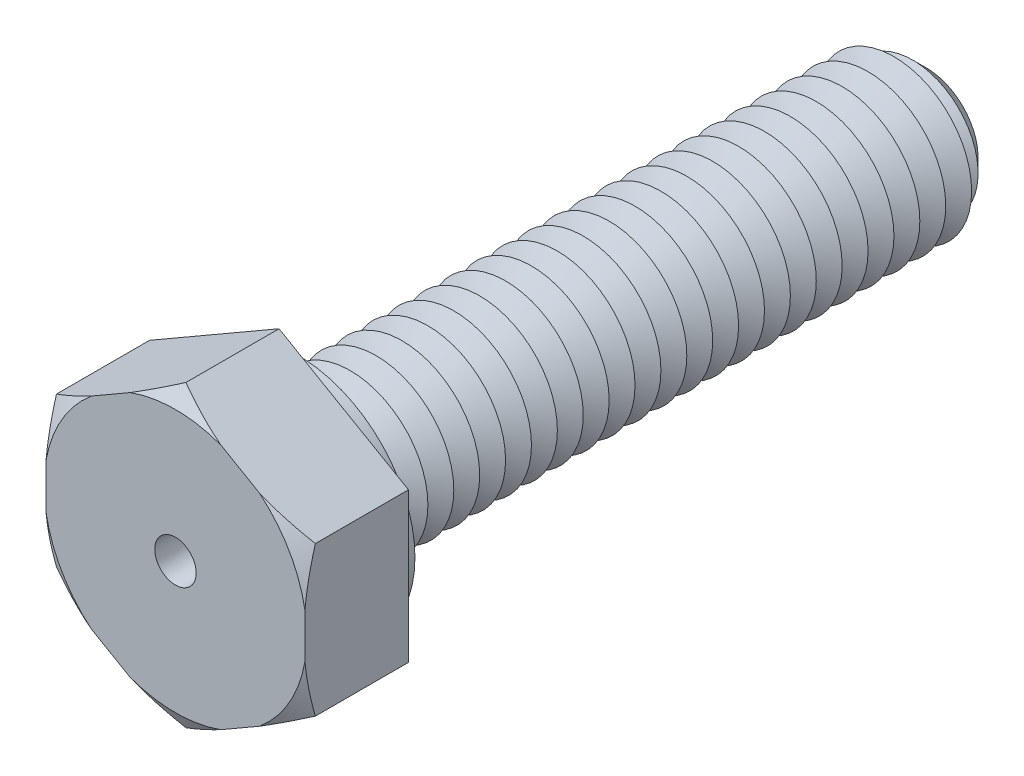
ISO-10303-21;
HEADER;
FILE_DESCRIPTION(('STEP AP214'),'2;1');
FILE_NAME('part.step','',(''),(''),'','','');
FILE_SCHEMA(('AUTOMOTIVE_DESIGN { 1 0 10303 214 1 1 1 1 }'));
ENDSEC;
DATA;
#1=APPLICATION_CONTEXT('core data for automotive mechanical design processes');
#2=APPLICATION_PROTOCOL_DEFINITION('international standard','automotive_design',2000,#1);
#3=PRODUCT_CONTEXT('',#1,'mechanical');
#4=PRODUCT('Part','Part','',(#3));
#5=PRODUCT_RELATED_PRODUCT_CATEGORY('part','',(#4));
#6=PRODUCT_DEFINITION_FORMATION('','',#4);
#7=PRODUCT_DEFINITION_CONTEXT('part definition',#1,'design');
#8=PRODUCT_DEFINITION('design','',#6,#7);
#9=PRODUCT_DEFINITION_SHAPE('','',#8);
#10=(LENGTH_UNIT() NAMED_UNIT(*) SI_UNIT(.MILLI.,.METRE.));
#11=(NAMED_UNIT(*) PLANE_ANGLE_UNIT() SI_UNIT($,.RADIAN.));
#12=(NAMED_UNIT(*) SI_UNIT($,.STERADIAN.) SOLID_ANGLE_UNIT());
#13=UNCERTAINTY_MEASURE_WITH_UNIT(LENGTH_MEASURE(1.E-05),#10,'distance_accuracy_value','');
#14=(GEOMETRIC_REPRESENTATION_CONTEXT(3) GLOBAL_UNCERTAINTY_ASSIGNED_CONTEXT((#13)) GLOBAL_UNIT_ASSIGNED_CONTEXT((#10,
#11,#12)) REPRESENTATION_CONTEXT('',''));
#15=CARTESIAN_POINT('',(0.,0.,0.));
#16=DIRECTION('',(0.,0.,1.));
#17=DIRECTION('',(1.,0.,0.));
#18=AXIS2_PLACEMENT_3D('',#15,#16,#17);
#19=CARTESIAN_POINT('',(5.,2.88675134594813,4.));
#20=DIRECTION('',(-0.5,-0.866025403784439,0.));
#21=DIRECTION('',(0.866025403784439,-0.5,0.));
#22=AXIS2_PLACEMENT_3D('',#19,#20,#21);
#23=PLANE('',#22);
#24=CARTESIAN_POINT('',(8.47277829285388,0.881741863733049,2.01100959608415));
#25=CARTESIAN_POINT('',(8.31567675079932,0.972444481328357,2.09578624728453));
#26=CARTESIAN_POINT('',(8.15819937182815,1.06336408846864,2.17964850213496));
#27=CARTESIAN_POINT('',(7.84233445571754,1.24572878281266,2.34511482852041));
#28=CARTESIAN_POINT('',(7.68394680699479,1.33717393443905,2.42671861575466));
#29=CARTESIAN_POINT('',(7.3656324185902,1.52095283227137,2.58747458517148));
#30=CARTESIAN_POINT('',(7.2057023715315,1.61328848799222,2.66661806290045));
#31=CARTESIAN_POINT('',(6.88464436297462,1.79865141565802,2.82158887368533));
#32=CARTESIAN_POINT('',(6.72351643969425,1.89167866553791,2.89741631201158));
#33=CARTESIAN_POINT('',(6.39574451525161,2.08091787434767,3.04691088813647));
#34=CARTESIAN_POINT('',(6.22906463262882,2.17715054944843,3.12047362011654));
#35=CARTESIAN_POINT('',(5.89404164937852,2.3705761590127,3.26235309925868));
#36=CARTESIAN_POINT('',(5.72569864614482,2.46776903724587,3.33067015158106));
#37=CARTESIAN_POINT('',(5.38728347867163,2.66315312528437,3.46077059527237));
#38=CARTESIAN_POINT('',(5.21721304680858,2.7613433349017,3.52255993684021));
#39=CARTESIAN_POINT('',(4.87507545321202,2.95887656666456,3.63817490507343));
#40=CARTESIAN_POINT('',(4.70300855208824,3.058219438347,3.69200155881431));
#41=CARTESIAN_POINT('',(4.29152467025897,3.29578976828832,3.8084273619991));
#42=CARTESIAN_POINT('',(4.05114917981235,3.43457062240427,3.86669526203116));
#43=CARTESIAN_POINT('',(3.68812002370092,3.64416560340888,3.93673911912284));
#44=CARTESIAN_POINT('',(3.56670137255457,3.71426669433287,3.95719387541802));
#45=CARTESIAN_POINT('',(3.32319777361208,3.85485356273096,3.99180309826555));
#46=CARTESIAN_POINT('',(3.20111291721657,3.92533928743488,4.0059584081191));
#47=CARTESIAN_POINT('',(2.95790980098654,4.06575267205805,4.0274398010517));
#48=CARTESIAN_POINT('',(2.83679666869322,4.13567737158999,4.03484289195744));
#49=CARTESIAN_POINT('',(2.59440145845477,4.27562431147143,4.04287861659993));
#50=CARTESIAN_POINT('',(2.47311938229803,4.34564655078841,4.0435113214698));
#51=CARTESIAN_POINT('',(2.23067249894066,4.48562332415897,4.03798617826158));
#52=CARTESIAN_POINT('',(2.10950769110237,4.55557785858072,4.03182836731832));
#53=CARTESIAN_POINT('',(1.86755304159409,4.695270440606,4.01290860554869));
#54=CARTESIAN_POINT('',(1.7467632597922,4.76500845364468,4.00014564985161));
#55=CARTESIAN_POINT('',(1.46148107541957,4.92971619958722,3.96252552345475));
#56=CARTESIAN_POINT('',(1.29725580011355,5.02453170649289,3.93494657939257));
#57=CARTESIAN_POINT('',(0.970375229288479,5.21325629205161,3.86938275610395));
#58=CARTESIAN_POINT('',(0.807720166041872,5.30716523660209,3.83139636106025));
#59=CARTESIAN_POINT('',(0.484000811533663,5.4940646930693,3.7464515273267));
#60=CARTESIAN_POINT('',(0.32293853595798,5.58705404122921,3.6994829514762));
#61=CARTESIAN_POINT('',(0.00262118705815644,5.77198934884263,3.59805355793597));
#62=CARTESIAN_POINT('',(-0.156634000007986,5.86393537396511,3.54359321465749));
#63=CARTESIAN_POINT('',(-0.475335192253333,6.04793759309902,3.42778810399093));
#64=CARTESIAN_POINT('',(-0.63476076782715,6.13998199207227,3.36636889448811));
#65=CARTESIAN_POINT('',(-0.951922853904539,6.3230956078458,3.2383676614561));
#66=CARTESIAN_POINT('',(-1.10966040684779,6.4141654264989,3.17178906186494));
#67=CARTESIAN_POINT('',(-1.42369760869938,6.59547488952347,3.03438397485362));
#68=CARTESIAN_POINT('',(-1.57999755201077,6.68571470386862,2.96355838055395));
#69=CARTESIAN_POINT('',(-1.89137153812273,6.86548655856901,2.81840247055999));
#70=CARTESIAN_POINT('',(-2.04644555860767,6.95501858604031,2.74407209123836));
#71=CARTESIAN_POINT('',(-2.30843737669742,7.1062796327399,2.61560341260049));
#72=CARTESIAN_POINT('',(-2.41563149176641,7.16816818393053,2.5622132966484));
#73=CARTESIAN_POINT('',(-2.62954890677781,7.29167346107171,2.45420118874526));
#74=CARTESIAN_POINT('',(-2.73627222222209,7.35329019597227,2.39957923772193));
#75=CARTESIAN_POINT('',(-2.94817046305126,7.4756297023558,2.28983212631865));
#76=CARTESIAN_POINT('',(-3.05334983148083,7.53635503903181,2.23471838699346));
#77=CARTESIAN_POINT('',(-3.26333506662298,7.65759007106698,2.12354428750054));
#78=CARTESIAN_POINT('',(-3.36814092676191,7.71809976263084,2.06748391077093));
#79=CARTESIAN_POINT('',(-3.47277829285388,7.77851217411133,2.01100959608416));
#80=B_SPLINE_CURVE_WITH_KNOTS('',3,(#24,#25,#26,#27,#28,#29,#30,#31,#32,#33,#34,#35,#36,#37,#38,
#39,#40,#41,#42,#43,#44,#45,#46,#47,#48,#49,#50,#51,#52,#53,#54,#55,#56,#57,#58,#59,#60,#61,#62,
#63,#64,#65,#66,#67,#68,#69,#70,#71,#72,#73,#74,#75,#76,#77,#78,#79),.UNSPECIFIED.,.F.,.F.,(4,2,
2,2,2,2,2,2,2,2,2,2,2,2,2,2,2,2,2,2,2,2,2,2,2,2,2,4),(0.,0.600718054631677,1.20151138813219,
1.80423204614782,2.40693355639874,3.02500509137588,3.64304064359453,4.26050788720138,
4.87789541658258,5.72780796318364,6.15275000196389,6.57763513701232,6.99761163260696,
7.41758371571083,7.83755350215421,8.25758719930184,8.83211758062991,9.40673168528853,
9.98199815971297,10.5572282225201,11.1393271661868,11.7210430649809,12.3026370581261,
12.8842416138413,13.2886376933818,13.6930203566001,14.0931288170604,14.493244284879),.UNSPECIFIED.);
#81=CARTESIAN_POINT('',(5.,2.88675134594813,3.59585481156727));
#82=VERTEX_POINT('',#81);
#83=CARTESIAN_POINT('',(3.24519941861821,3.89988593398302,4.));
#84=VERTEX_POINT('',#83);
#85=EDGE_CURVE('E132',#82,#84,#80,.T.);
#86=ORIENTED_EDGE('',*,*,#85,.F.);
#87=DIRECTION('',(0.,0.,-1.));
#88=VECTOR('',#87,1.);
#89=CARTESIAN_POINT('',(5.,2.88675134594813,4.));
#90=LINE('',#89,#88);
#91=CARTESIAN_POINT('',(5.,2.88675134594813,0.));
#92=VERTEX_POINT('',#91);
#93=EDGE_CURVE('E144',#82,#92,#90,.T.);
#94=ORIENTED_EDGE('',*,*,#93,.T.);
#95=DIRECTION('',(-0.866025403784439,0.5,0.));
#96=VECTOR('',#95,1.);
#97=CARTESIAN_POINT('',(5.,2.88675134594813,0.));
#98=LINE('',#97,#96);
#99=CARTESIAN_POINT('',(0.,5.77350269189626,0.));
#100=VERTEX_POINT('',#99);
#101=EDGE_CURVE('E394',#92,#100,#98,.T.);
#102=ORIENTED_EDGE('',*,*,#101,.T.);
#103=DIRECTION('',(0.,0.,-1.));
#104=VECTOR('',#103,1.);
#105=CARTESIAN_POINT('',(0.,5.77350269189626,4.));
#106=LINE('',#105,#104);
#107=CARTESIAN_POINT('',(0.,5.77350269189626,3.59585481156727));
#108=VERTEX_POINT('',#107);
#109=EDGE_CURVE('E179',#108,#100,#106,.T.);
#110=ORIENTED_EDGE('',*,*,#109,.F.);
#111=CARTESIAN_POINT('',(1.75480058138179,4.76036810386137,4.));
#112=VERTEX_POINT('',#111);
#113=EDGE_CURVE('E151',#112,#108,#80,.T.);
#114=ORIENTED_EDGE('',*,*,#113,.F.);
#115=DIRECTION('',(-0.866025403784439,0.5,0.));
#116=VECTOR('',#115,1.);
#117=CARTESIAN_POINT('',(5.,2.88675134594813,4.));
#118=LINE('',#117,#116);
#119=EDGE_CURVE('E148',#84,#112,#118,.T.);
#120=ORIENTED_EDGE('',*,*,#119,.F.);
#121=EDGE_LOOP('',(#86,#94,#102,#110,#114,#120));
#122=FACE_BOUND('',#121,.T.);
#123=ADVANCED_FACE('F39',(#122),#23,.F.);
#124=CARTESIAN_POINT('',(0.,5.77350269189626,4.));
#125=DIRECTION('',(0.5,-0.866025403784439,0.));
#126=DIRECTION('',(0.866025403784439,0.5,0.));
#127=AXIS2_PLACEMENT_3D('',#124,#125,#126);
#128=PLANE('',#127);
#129=CARTESIAN_POINT('',(3.47277829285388,7.77851217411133,2.01100959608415));
#130=CARTESIAN_POINT('',(3.31567675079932,7.68780955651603,2.09578624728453));
#131=CARTESIAN_POINT('',(3.15819937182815,7.59688994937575,2.17964850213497));
#132=CARTESIAN_POINT('',(2.84233445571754,7.41452525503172,2.34511482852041));
#133=CARTESIAN_POINT('',(2.68394680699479,7.32308010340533,2.42671861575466));
#134=CARTESIAN_POINT('',(2.36563241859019,7.13930120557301,2.58747458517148));
#135=CARTESIAN_POINT('',(2.2057023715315,7.04696554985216,2.66661806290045));
#136=CARTESIAN_POINT('',(1.88464436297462,6.86160262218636,2.82158887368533));
#137=CARTESIAN_POINT('',(1.72351643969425,6.76857537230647,2.89741631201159));
#138=CARTESIAN_POINT('',(1.39574451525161,6.57933616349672,3.04691088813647));
#139=CARTESIAN_POINT('',(1.22906463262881,6.48310348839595,3.12047362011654));
#140=CARTESIAN_POINT('',(0.894041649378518,6.28967787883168,3.26235309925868));
#141=CARTESIAN_POINT('',(0.725698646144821,6.19248500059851,3.33067015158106));
#142=CARTESIAN_POINT('',(0.38728347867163,5.99710091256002,3.46077059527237));
#143=CARTESIAN_POINT('',(0.217213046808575,5.89891070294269,3.52255993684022));
#144=CARTESIAN_POINT('',(-0.124924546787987,5.70137747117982,3.63817490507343));
#145=CARTESIAN_POINT('',(-0.296991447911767,5.60203459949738,3.69200155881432));
#146=CARTESIAN_POINT('',(-0.708475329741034,5.36446426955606,3.8084273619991));
#147=CARTESIAN_POINT('',(-0.948850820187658,5.22568341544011,3.86669526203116));
#148=CARTESIAN_POINT('',(-1.31187997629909,5.0160884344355,3.93673911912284));
#149=CARTESIAN_POINT('',(-1.43329862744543,4.94598734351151,3.95719387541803));
#150=CARTESIAN_POINT('',(-1.67680222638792,4.80540047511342,3.99180309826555));
#151=CARTESIAN_POINT('',(-1.79888708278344,4.7349147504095,4.0059584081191));
#152=CARTESIAN_POINT('',(-2.04209019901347,4.59450136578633,4.0274398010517));
#153=CARTESIAN_POINT('',(-2.16320333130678,4.52457666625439,4.03484289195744));
#154=CARTESIAN_POINT('',(-2.40559854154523,4.38462972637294,4.04287861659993));
#155=CARTESIAN_POINT('',(-2.52688061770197,4.31460748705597,4.04351132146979));
#156=CARTESIAN_POINT('',(-2.76932750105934,4.17463071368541,4.03798617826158));
#157=CARTESIAN_POINT('',(-2.89049230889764,4.10467617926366,4.03182836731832));
#158=CARTESIAN_POINT('',(-3.13244695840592,3.96498359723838,4.01290860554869));
#159=CARTESIAN_POINT('',(-3.25323674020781,3.8952455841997,4.00014564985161));
#160=CARTESIAN_POINT('',(-3.53851892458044,3.73053783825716,3.96252552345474));
#161=CARTESIAN_POINT('',(-3.70274419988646,3.63572233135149,3.93494657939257));
#162=CARTESIAN_POINT('',(-4.02962477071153,3.44699774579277,3.86938275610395));
#163=CARTESIAN_POINT('',(-4.19227983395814,3.35308880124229,3.83139636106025));
#164=CARTESIAN_POINT('',(-4.51599918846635,3.16618934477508,3.7464515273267));
#165=CARTESIAN_POINT('',(-4.67706146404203,3.07319999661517,3.6994829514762));
#166=CARTESIAN_POINT('',(-4.99737881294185,2.88826468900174,3.59805355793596));
#167=CARTESIAN_POINT('',(-5.156634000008,2.79631866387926,3.54359321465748));
#168=CARTESIAN_POINT('',(-5.47533519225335,2.61231644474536,3.42778810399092));
#169=CARTESIAN_POINT('',(-5.63476076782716,2.5202720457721,3.3663688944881));
#170=CARTESIAN_POINT('',(-5.95192285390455,2.33715842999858,3.23836766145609));
#171=CARTESIAN_POINT('',(-6.10966040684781,2.24608861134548,3.17178906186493));
#172=CARTESIAN_POINT('',(-6.4236976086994,2.0647791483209,3.03438397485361));
#173=CARTESIAN_POINT('',(-6.57999755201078,1.97453933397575,2.96355838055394));
#174=CARTESIAN_POINT('',(-6.89137153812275,1.79476747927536,2.81840247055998));
#175=CARTESIAN_POINT('',(-7.04644555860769,1.70523545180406,2.74407209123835));
#176=CARTESIAN_POINT('',(-7.30843737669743,1.55397440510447,2.61560341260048));
#177=CARTESIAN_POINT('',(-7.41563149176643,1.49208585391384,2.56221329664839));
#178=CARTESIAN_POINT('',(-7.62954890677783,1.36858057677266,2.45420118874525));
#179=CARTESIAN_POINT('',(-7.7362722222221,1.30696384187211,2.39957923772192));
#180=CARTESIAN_POINT('',(-7.94817046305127,1.18462433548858,2.28983212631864));
#181=CARTESIAN_POINT('',(-8.05334983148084,1.12389899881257,2.23471838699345));
#182=CARTESIAN_POINT('',(-8.26333506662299,1.0026639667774,2.12354428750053));
#183=CARTESIAN_POINT('',(-8.36814092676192,0.94215427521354,2.06748391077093));
#184=CARTESIAN_POINT('',(-8.47277829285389,0.881741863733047,2.01100959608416));
#185=B_SPLINE_CURVE_WITH_KNOTS('',3,(#129,#130,#131,#132,#133,#134,#135,#136,#137,#138,#139,
#140,#141,#142,#143,#144,#145,#146,#147,#148,#149,#150,#151,#152,#153,#154,#155,#156,#157,#158,
#159,#160,#161,#162,#163,#164,#165,#166,#167,#168,#169,#170,#171,#172,#173,#174,#175,#176,#177,
#178,#179,#180,#181,#182,#183,#184),.UNSPECIFIED.,.F.,.F.,(4,2,2,2,2,2,2,2,2,2,2,2,2,2,2,2,2,2,
2,2,2,2,2,2,2,2,2,4),(0.,0.600718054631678,1.20151138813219,1.80423204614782,2.40693355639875,
3.02500509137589,3.64304064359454,4.26050788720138,4.87789541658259,5.72780796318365,
6.1527500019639,6.57763513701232,6.99761163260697,7.41758371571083,7.83755350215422,
8.25758719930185,8.83211758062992,9.40673168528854,9.98199815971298,10.5572282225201,
11.1393271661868,11.7210430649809,12.3026370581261,12.8842416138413,13.2886376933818,
13.6930203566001,14.0931288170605,14.493244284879),.UNSPECIFIED.);
#186=CARTESIAN_POINT('',(-1.75480058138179,4.76036810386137,4.));
#187=VERTEX_POINT('',#186);
#188=EDGE_CURVE('E448',#108,#187,#185,.T.);
#189=ORIENTED_EDGE('',*,*,#188,.F.);
#190=ORIENTED_EDGE('',*,*,#109,.T.);
#191=DIRECTION('',(-0.866025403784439,-0.5,0.));
#192=VECTOR('',#191,1.);
#193=CARTESIAN_POINT('',(0.,5.77350269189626,0.));
#194=LINE('',#193,#192);
#195=CARTESIAN_POINT('',(-5.,2.88675134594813,0.));
#196=VERTEX_POINT('',#195);
#197=EDGE_CURVE('E414',#100,#196,#194,.T.);
#198=ORIENTED_EDGE('',*,*,#197,.T.);
#199=DIRECTION('',(0.,0.,-1.));
#200=VECTOR('',#199,1.);
#201=CARTESIAN_POINT('',(-5.,2.88675134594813,4.));
#202=LINE('',#201,#200);
#203=CARTESIAN_POINT('',(-5.,2.88675134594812,3.59585481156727));
#204=VERTEX_POINT('',#203);
#205=EDGE_CURVE('E176',#204,#196,#202,.T.);
#206=ORIENTED_EDGE('',*,*,#205,.F.);
#207=CARTESIAN_POINT('',(-3.24519941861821,3.89988593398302,4.));
#208=VERTEX_POINT('',#207);
#209=EDGE_CURVE('E501',#208,#204,#185,.T.);
#210=ORIENTED_EDGE('',*,*,#209,.F.);
#211=DIRECTION('',(-0.866025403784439,-0.5,0.));
#212=VECTOR('',#211,1.);
#213=CARTESIAN_POINT('',(0.,5.77350269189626,4.));
#214=LINE('',#213,#212);
#215=EDGE_CURVE('E397',#187,#208,#214,.T.);
#216=ORIENTED_EDGE('',*,*,#215,.F.);
#217=EDGE_LOOP('',(#189,#190,#198,#206,#210,#216));
#218=FACE_BOUND('',#217,.T.);
#219=ADVANCED_FACE('F510',(#218),#128,.F.);
#220=CARTESIAN_POINT('',(-5.,2.88675134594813,4.));
#221=DIRECTION('',(1.,0.,0.));
#222=DIRECTION('',(0.,0.,-1.));
#223=AXIS2_PLACEMENT_3D('',#220,#221,#222);
#224=PLANE('',#223);
#225=CARTESIAN_POINT('',(-5.,6.35952963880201,2.25858442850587));
#226=CARTESIAN_POINT('',(-5.,6.17888675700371,2.34055079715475));
#227=CARTESIAN_POINT('',(-5.,5.99774985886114,2.42144915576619));
#228=CARTESIAN_POINT('',(-5.,5.63427640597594,2.58059164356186));
#229=CARTESIAN_POINT('',(-5.,5.45193964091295,2.65883529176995));
#230=CARTESIAN_POINT('',(-5.,5.08515575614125,2.81244019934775));
#231=CARTESIAN_POINT('',(-5.,4.90070300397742,2.8877880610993));
#232=CARTESIAN_POINT('',(-5.,4.53023851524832,3.0345384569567));
#233=CARTESIAN_POINT('',(-5.,4.34422685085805,3.10594117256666));
#234=CARTESIAN_POINT('',(-5.,3.9712497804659,3.24361472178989));
#235=CARTESIAN_POINT('',(-5.,3.78429235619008,3.30990707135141));
#236=CARTESIAN_POINT('',(-5.,3.40837814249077,3.43663614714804));
#237=CARTESIAN_POINT('',(-5.,3.21942124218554,3.49707254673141));
#238=CARTESIAN_POINT('',(-5.,2.83960832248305,3.61070280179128));
#239=CARTESIAN_POINT('',(-5.,2.64875526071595,3.66390646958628));
#240=CARTESIAN_POINT('',(-5.,2.26482213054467,3.76165698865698));
#241=CARTESIAN_POINT('',(-5.,2.07174215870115,3.80620421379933));
#242=CARTESIAN_POINT('',(-5.,1.7384332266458,3.87385543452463));
#243=CARTESIAN_POINT('',(-5.,1.59871159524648,3.89946008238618));
#244=CARTESIAN_POINT('',(-5.,1.31833206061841,3.94478995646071));
#245=CARTESIAN_POINT('',(-5.,1.17767431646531,3.96451615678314));
#246=CARTESIAN_POINT('',(-5.,0.895629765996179,3.99757345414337));
#247=CARTESIAN_POINT('',(-5.,0.754243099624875,4.01090573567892));
#248=CARTESIAN_POINT('',(-5.,0.470989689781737,4.03079351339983));
#249=CARTESIAN_POINT('',(-5.,0.329122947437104,4.03734902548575));
#250=CARTESIAN_POINT('',(-5.,0.0453101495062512,4.04347876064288));
#251=CARTESIAN_POINT('',(-5.,-0.0966358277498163,4.04305657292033));
#252=CARTESIAN_POINT('',(-5.,-0.380333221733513,4.03525341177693));
#253=CARTESIAN_POINT('',(-5.,-0.522084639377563,4.02787247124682));
#254=CARTESIAN_POINT('',(-5.,-0.805078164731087,4.00637695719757));
#255=CARTESIAN_POINT('',(-5.,-0.946320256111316,3.99226216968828));
#256=CARTESIAN_POINT('',(-5.,-1.22803871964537,3.95770663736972));
#257=CARTESIAN_POINT('',(-5.,-1.36851494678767,3.93726473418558));
#258=CARTESIAN_POINT('',(-5.,-1.92842653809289,3.84388033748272));
#259=CARTESIAN_POINT('',(-5.,-2.34409397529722,3.74768165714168));
#260=CARTESIAN_POINT('',(-5.,-2.95991397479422,3.57615402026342));
#261=CARTESIAN_POINT('',(-5.,-3.16417440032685,3.51433916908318));
#262=CARTESIAN_POINT('',(-5.,-3.57033913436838,3.3833457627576));
#263=CARTESIAN_POINT('',(-5.,-3.77224360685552,3.31416772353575));
#264=CARTESIAN_POINT('',(-5.,-4.17620397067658,3.16907432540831));
#265=CARTESIAN_POINT('',(-5.,-4.37823505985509,3.09309081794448));
#266=CARTESIAN_POINT('',(-5.,-4.78041106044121,2.93626257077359));
#267=CARTESIAN_POINT('',(-5.,-4.98055585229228,2.85541752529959));
#268=CARTESIAN_POINT('',(-5.,-5.37797431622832,2.69033488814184));
#269=CARTESIAN_POINT('',(-5.,-5.57525810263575,2.60612151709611));
#270=CARTESIAN_POINT('',(-5.,-5.96839598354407,2.43454627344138));
#271=CARTESIAN_POINT('',(-5.,-6.16425041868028,2.34718518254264));
#272=CARTESIAN_POINT('',(-5.,-6.35952963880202,2.25858442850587));
#273=B_SPLINE_CURVE_WITH_KNOTS('',3,(#225,#226,#227,#228,#229,#230,#231,#232,#233,#234,#235,
#236,#237,#238,#239,#240,#241,#242,#243,#244,#245,#246,#247,#248,#249,#250,#251,#252,#253,#254,
#255,#256,#257,#258,#259,#260,#261,#262,#263,#264,#265,#266,#267,#268,#269,#270,#271,#272),
.UNSPECIFIED.,.F.,.F.,(4,2,2,2,2,2,2,2,2,2,2,2,2,2,2,2,2,2,2,2,2,2,2,4),(0.,0.595116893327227,
1.19034103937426,1.78805021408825,2.3857318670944,2.98074146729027,3.57578423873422,
4.17001151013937,4.7642131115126,5.19024951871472,5.61621528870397,6.0421021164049,
6.46798794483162,6.89365471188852,7.3193194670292,7.74499774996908,8.17075401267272,
9.44769357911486,10.0878733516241,10.7280082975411,11.3754821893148,12.0229968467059,
12.6664852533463,13.3098149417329),.UNSPECIFIED.);
#274=CARTESIAN_POINT('',(-5.,0.86048216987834,4.));
#275=VERTEX_POINT('',#274);
#276=EDGE_CURVE('E453',#204,#275,#273,.T.);
#277=ORIENTED_EDGE('',*,*,#276,.F.);
#278=ORIENTED_EDGE('',*,*,#205,.T.);
#279=DIRECTION('',(0.,-1.,0.));
#280=VECTOR('',#279,1.);
#281=CARTESIAN_POINT('',(-5.,2.88675134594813,0.));
#282=LINE('',#281,#280);
#283=CARTESIAN_POINT('',(-5.,-2.88675134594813,0.));
#284=VERTEX_POINT('',#283);
#285=EDGE_CURVE('E418',#196,#284,#282,.T.);
#286=ORIENTED_EDGE('',*,*,#285,.T.);
#287=DIRECTION('',(0.,0.,-1.));
#288=VECTOR('',#287,1.);
#289=CARTESIAN_POINT('',(-5.,-2.88675134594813,4.));
#290=LINE('',#289,#288);
#291=CARTESIAN_POINT('',(-4.99999999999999,-2.88675134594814,3.59585481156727));
#292=VERTEX_POINT('',#291);
#293=EDGE_CURVE('E173',#292,#284,#290,.T.);
#294=ORIENTED_EDGE('',*,*,#293,.F.);
#295=CARTESIAN_POINT('',(-5.,-0.86048216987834,4.));
#296=VERTEX_POINT('',#295);
#297=EDGE_CURVE('E439',#296,#292,#273,.T.);
#298=ORIENTED_EDGE('',*,*,#297,.F.);
#299=DIRECTION('',(0.,-1.,0.));
#300=VECTOR('',#299,1.);
#301=CARTESIAN_POINT('',(-5.,2.88675134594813,4.));
#302=LINE('',#301,#300);
#303=EDGE_CURVE('E401',#275,#296,#302,.T.);
#304=ORIENTED_EDGE('',*,*,#303,.F.);
#305=EDGE_LOOP('',(#277,#278,#286,#294,#298,#304));
#306=FACE_BOUND('',#305,.T.);
#307=ADVANCED_FACE('F506',(#306),#224,.F.);
#308=CARTESIAN_POINT('',(-5.,-2.88675134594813,4.));
#309=DIRECTION('',(0.5,0.866025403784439,0.));
#310=DIRECTION('',(-0.866025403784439,0.5,0.));
#311=AXIS2_PLACEMENT_3D('',#308,#309,#310);
#312=PLANE('',#311);
#313=CARTESIAN_POINT('',(-8.47277829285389,-0.881741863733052,2.01100959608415));
#314=CARTESIAN_POINT('',(-8.31567675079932,-0.972444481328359,2.09578624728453));
#315=CARTESIAN_POINT('',(-8.15819937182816,-1.06336408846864,2.17964850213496));
#316=CARTESIAN_POINT('',(-7.84233445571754,-1.24572878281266,2.34511482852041));
#317=CARTESIAN_POINT('',(-7.68394680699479,-1.33717393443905,2.42671861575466));
#318=CARTESIAN_POINT('',(-7.3656324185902,-1.52095283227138,2.58747458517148));
#319=CARTESIAN_POINT('',(-7.2057023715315,-1.61328848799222,2.66661806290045));
#320=CARTESIAN_POINT('',(-6.88464436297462,-1.79865141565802,2.82158887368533));
#321=CARTESIAN_POINT('',(-6.72351643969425,-1.89167866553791,2.89741631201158));
#322=CARTESIAN_POINT('',(-6.39574451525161,-2.08091787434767,3.04691088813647));
#323=CARTESIAN_POINT('',(-6.22906463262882,-2.17715054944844,3.12047362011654));
#324=CARTESIAN_POINT('',(-5.89404164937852,-2.37057615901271,3.26235309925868));
#325=CARTESIAN_POINT('',(-5.72569864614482,-2.46776903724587,3.33067015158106));
#326=CARTESIAN_POINT('',(-5.38728347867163,-2.66315312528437,3.46077059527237));
#327=CARTESIAN_POINT('',(-5.21721304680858,-2.7613433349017,3.52255993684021));
#328=CARTESIAN_POINT('',(-4.87507545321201,-2.95887656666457,3.63817490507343));
#329=CARTESIAN_POINT('',(-4.70300855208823,-3.05821943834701,3.69200155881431));
#330=CARTESIAN_POINT('',(-4.29152467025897,-3.29578976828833,3.8084273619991));
#331=CARTESIAN_POINT('',(-4.05114917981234,-3.43457062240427,3.86669526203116));
#332=CARTESIAN_POINT('',(-3.68812002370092,-3.64416560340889,3.93673911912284));
#333=CARTESIAN_POINT('',(-3.56670137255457,-3.71426669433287,3.95719387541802));
#334=CARTESIAN_POINT('',(-3.32319777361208,-3.85485356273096,3.99180309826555));
#335=CARTESIAN_POINT('',(-3.20111291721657,-3.92533928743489,4.0059584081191));
#336=CARTESIAN_POINT('',(-2.95790980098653,-4.06575267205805,4.0274398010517));
#337=CARTESIAN_POINT('',(-2.83679666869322,-4.13567737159,4.03484289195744));
#338=CARTESIAN_POINT('',(-2.59440145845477,-4.27562431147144,4.04287861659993));
#339=CARTESIAN_POINT('',(-2.47311938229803,-4.34564655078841,4.04351132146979));
#340=CARTESIAN_POINT('',(-2.23067249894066,-4.48562332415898,4.03798617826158));
#341=CARTESIAN_POINT('',(-2.10950769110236,-4.55557785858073,4.03182836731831));
#342=CARTESIAN_POINT('',(-1.86755304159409,-4.69527044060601,4.01290860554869));
#343=CARTESIAN_POINT('',(-1.74676325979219,-4.76500845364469,4.00014564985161));
#344=CARTESIAN_POINT('',(-1.46148107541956,-4.92971619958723,3.96252552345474));
#345=CARTESIAN_POINT('',(-1.29725580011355,-5.0245317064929,3.93494657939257));
#346=CARTESIAN_POINT('',(-0.970375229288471,-5.21325629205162,3.86938275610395));
#347=CARTESIAN_POINT('',(-0.807720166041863,-5.3071652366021,3.83139636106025));
#348=CARTESIAN_POINT('',(-0.484000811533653,-5.49406469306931,3.7464515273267));
#349=CARTESIAN_POINT('',(-0.322938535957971,-5.58705404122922,3.6994829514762));
#350=CARTESIAN_POINT('',(-0.00262118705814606,-5.77198934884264,3.59805355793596));
#351=CARTESIAN_POINT('',(0.156634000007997,-5.86393537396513,3.54359321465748));
#352=CARTESIAN_POINT('',(0.475335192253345,-6.04793759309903,3.42778810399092));
#353=CARTESIAN_POINT('',(0.634760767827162,-6.13998199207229,3.3663688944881));
#354=CARTESIAN_POINT('',(0.951922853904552,-6.32309560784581,3.23836766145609));
#355=CARTESIAN_POINT('',(1.10966040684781,-6.41416542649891,3.17178906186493));
#356=CARTESIAN_POINT('',(1.4236976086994,-6.59547488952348,3.03438397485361));
#357=CARTESIAN_POINT('',(1.57999755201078,-6.68571470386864,2.96355838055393));
#358=CARTESIAN_POINT('',(1.89137153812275,-6.86548655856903,2.81840247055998));
#359=CARTESIAN_POINT('',(2.04644555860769,-6.95501858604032,2.74407209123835));
#360=CARTESIAN_POINT('',(2.30843737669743,-7.10627963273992,2.61560341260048));
#361=CARTESIAN_POINT('',(2.41563149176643,-7.16816818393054,2.56221329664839));
#362=CARTESIAN_POINT('',(2.62954890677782,-7.29167346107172,2.45420118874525));
#363=CARTESIAN_POINT('',(2.73627222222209,-7.35329019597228,2.39957923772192));
#364=CARTESIAN_POINT('',(2.94817046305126,-7.47562970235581,2.28983212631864));
#365=CARTESIAN_POINT('',(3.05334983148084,-7.53635503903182,2.23471838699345));
#366=CARTESIAN_POINT('',(3.26333506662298,-7.65759007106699,2.12354428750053));
#367=CARTESIAN_POINT('',(3.36814092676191,-7.71809976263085,2.06748391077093));
#368=CARTESIAN_POINT('',(3.47277829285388,-7.77851217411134,2.01100959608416));
#369=B_SPLINE_CURVE_WITH_KNOTS('',3,(#313,#314,#315,#316,#317,#318,#319,#320,#321,#322,#323,
#324,#325,#326,#327,#328,#329,#330,#331,#332,#333,#334,#335,#336,#337,#338,#339,#340,#341,#342,
#343,#344,#345,#346,#347,#348,#349,#350,#351,#352,#353,#354,#355,#356,#357,#358,#359,#360,#361,
#362,#363,#364,#365,#366,#367,#368),.UNSPECIFIED.,.F.,.F.,(4,2,2,2,2,2,2,2,2,2,2,2,2,2,2,2,2,2,
2,2,2,2,2,2,2,2,2,4),(0.,0.600718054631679,1.20151138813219,1.80423204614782,2.40693355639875,
3.02500509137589,3.64304064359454,4.26050788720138,4.87789541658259,5.72780796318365,
6.1527500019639,6.57763513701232,6.99761163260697,7.41758371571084,7.83755350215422,
8.25758719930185,8.83211758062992,9.40673168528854,9.98199815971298,10.5572282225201,
11.1393271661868,11.7210430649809,12.3026370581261,12.8842416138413,13.2886376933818,
13.6930203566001,14.0931288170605,14.493244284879),.UNSPECIFIED.);
#370=CARTESIAN_POINT('',(-3.24519941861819,-3.89988593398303,4.));
#371=VERTEX_POINT('',#370);
#372=EDGE_CURVE('E438',#292,#371,#369,.T.);
#373=ORIENTED_EDGE('',*,*,#372,.F.);
#374=ORIENTED_EDGE('',*,*,#293,.T.);
#375=DIRECTION('',(0.866025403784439,-0.5,0.));
#376=VECTOR('',#375,1.);
#377=CARTESIAN_POINT('',(-5.,-2.88675134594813,0.));
#378=LINE('',#377,#376);
#379=CARTESIAN_POINT('',(0.,-5.77350269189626,0.));
#380=VERTEX_POINT('',#379);
#381=EDGE_CURVE('E422',#284,#380,#378,.T.);
#382=ORIENTED_EDGE('',*,*,#381,.T.);
#383=DIRECTION('',(0.,0.,-1.));
#384=VECTOR('',#383,1.);
#385=CARTESIAN_POINT('',(0.,-5.77350269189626,4.));
#386=LINE('',#385,#384);
#387=CARTESIAN_POINT('',(0.,-5.77350269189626,3.59585481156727));
#388=VERTEX_POINT('',#387);
#389=EDGE_CURVE('E163',#388,#380,#386,.T.);
#390=ORIENTED_EDGE('',*,*,#389,.F.);
#391=CARTESIAN_POINT('',(-1.75480058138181,-4.76036810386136,4.));
#392=VERTEX_POINT('',#391);
#393=EDGE_CURVE('E440',#392,#388,#369,.T.);
#394=ORIENTED_EDGE('',*,*,#393,.F.);
#395=DIRECTION('',(0.866025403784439,-0.5,0.));
#396=VECTOR('',#395,1.);
#397=CARTESIAN_POINT('',(-5.,-2.88675134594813,4.));
#398=LINE('',#397,#396);
#399=EDGE_CURVE('E405',#371,#392,#398,.T.);
#400=ORIENTED_EDGE('',*,*,#399,.F.);
#401=EDGE_LOOP('',(#373,#374,#382,#390,#394,#400));
#402=FACE_BOUND('',#401,.T.);
#403=ADVANCED_FACE('F509',(#402),#312,.F.);
#404=CARTESIAN_POINT('',(0.,-5.77350269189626,4.));
#405=DIRECTION('',(-0.5,0.866025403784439,0.));
#406=DIRECTION('',(-0.866025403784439,-0.5,0.));
#407=AXIS2_PLACEMENT_3D('',#404,#405,#406);
#408=PLANE('',#407);
#409=CARTESIAN_POINT('',(-3.47277829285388,-7.77851217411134,2.01100959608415));
#410=CARTESIAN_POINT('',(-3.31567675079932,-7.68780955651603,2.09578624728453));
#411=CARTESIAN_POINT('',(-3.15819937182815,-7.59688994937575,2.17964850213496));
#412=CARTESIAN_POINT('',(-2.84233445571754,-7.41452525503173,2.34511482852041));
#413=CARTESIAN_POINT('',(-2.68394680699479,-7.32308010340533,2.42671861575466));
#414=CARTESIAN_POINT('',(-2.36563241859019,-7.13930120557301,2.58747458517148));
#415=CARTESIAN_POINT('',(-2.2057023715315,-7.04696554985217,2.66661806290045));
#416=CARTESIAN_POINT('',(-1.88464436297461,-6.86160262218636,2.82158887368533));
#417=CARTESIAN_POINT('',(-1.72351643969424,-6.76857537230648,2.89741631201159));
#418=CARTESIAN_POINT('',(-1.39574451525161,-6.57933616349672,3.04691088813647));
#419=CARTESIAN_POINT('',(-1.22906463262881,-6.48310348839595,3.12047362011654));
#420=CARTESIAN_POINT('',(-0.894041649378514,-6.28967787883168,3.26235309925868));
#421=CARTESIAN_POINT('',(-0.725698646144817,-6.19248500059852,3.33067015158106));
#422=CARTESIAN_POINT('',(-0.387283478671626,-5.99710091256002,3.46077059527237));
#423=CARTESIAN_POINT('',(-0.217213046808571,-5.89891070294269,3.52255993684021));
#424=CARTESIAN_POINT('',(0.124924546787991,-5.70137747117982,3.63817490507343));
#425=CARTESIAN_POINT('',(0.296991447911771,-5.60203459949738,3.69200155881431));
#426=CARTESIAN_POINT('',(0.708475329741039,-5.36446426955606,3.8084273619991));
#427=CARTESIAN_POINT('',(0.948850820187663,-5.22568341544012,3.86669526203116));
#428=CARTESIAN_POINT('',(1.31187997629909,-5.0160884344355,3.93673911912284));
#429=CARTESIAN_POINT('',(1.43329862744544,-4.94598734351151,3.95719387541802));
#430=CARTESIAN_POINT('',(1.67680222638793,-4.80540047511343,3.99180309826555));
#431=CARTESIAN_POINT('',(1.79888708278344,-4.7349147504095,4.0059584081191));
#432=CARTESIAN_POINT('',(2.04209019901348,-4.59450136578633,4.0274398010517));
#433=CARTESIAN_POINT('',(2.16320333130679,-4.52457666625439,4.03484289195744));
#434=CARTESIAN_POINT('',(2.40559854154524,-4.38462972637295,4.04287861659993));
#435=CARTESIAN_POINT('',(2.52688061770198,-4.31460748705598,4.04351132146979));
#436=CARTESIAN_POINT('',(2.76932750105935,-4.17463071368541,4.03798617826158));
#437=CARTESIAN_POINT('',(2.89049230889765,-4.10467617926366,4.03182836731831));
#438=CARTESIAN_POINT('',(3.13244695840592,-3.96498359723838,4.01290860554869));
#439=CARTESIAN_POINT('',(3.25323674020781,-3.8952455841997,4.00014564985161));
#440=CARTESIAN_POINT('',(3.53851892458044,-3.73053783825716,3.96252552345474));
#441=CARTESIAN_POINT('',(3.70274419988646,-3.63572233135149,3.93494657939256));
#442=CARTESIAN_POINT('',(4.02962477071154,-3.44699774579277,3.86938275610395));
#443=CARTESIAN_POINT('',(4.19227983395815,-3.35308880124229,3.83139636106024));
#444=CARTESIAN_POINT('',(4.51599918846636,-3.16618934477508,3.7464515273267));
#445=CARTESIAN_POINT('',(4.67706146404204,-3.07319999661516,3.69948295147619));
#446=CARTESIAN_POINT('',(4.99737881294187,-2.88826468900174,3.59805355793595));
#447=CARTESIAN_POINT('',(5.15663400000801,-2.79631866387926,3.54359321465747));
#448=CARTESIAN_POINT('',(5.47533519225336,-2.61231644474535,3.42778810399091));
#449=CARTESIAN_POINT('',(5.63476076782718,-2.5202720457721,3.3663688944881));
#450=CARTESIAN_POINT('',(5.95192285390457,-2.33715842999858,3.23836766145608));
#451=CARTESIAN_POINT('',(6.10966040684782,-2.24608861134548,3.17178906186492));
#452=CARTESIAN_POINT('',(6.42369760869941,-2.0647791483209,3.0343839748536));
#453=CARTESIAN_POINT('',(6.5799975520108,-1.97453933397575,2.96355838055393));
#454=CARTESIAN_POINT('',(6.89137153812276,-1.79476747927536,2.81840247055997));
#455=CARTESIAN_POINT('',(7.04644555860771,-1.70523545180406,2.74407209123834));
#456=CARTESIAN_POINT('',(7.30843737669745,-1.55397440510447,2.61560341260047));
#457=CARTESIAN_POINT('',(7.41563149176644,-1.49208585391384,2.56221329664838));
#458=CARTESIAN_POINT('',(7.62954890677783,-1.36858057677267,2.45420118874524));
#459=CARTESIAN_POINT('',(7.7362722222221,-1.30696384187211,2.39957923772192));
#460=CARTESIAN_POINT('',(7.94817046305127,-1.18462433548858,2.28983212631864));
#461=CARTESIAN_POINT('',(8.05334983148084,-1.12389899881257,2.23471838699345));
#462=CARTESIAN_POINT('',(8.26333506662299,-1.00266396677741,2.12354428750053));
#463=CARTESIAN_POINT('',(8.36814092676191,-0.942154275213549,2.06748391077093));
#464=CARTESIAN_POINT('',(8.47277829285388,-0.881741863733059,2.01100959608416));
#465=B_SPLINE_CURVE_WITH_KNOTS('',3,(#409,#410,#411,#412,#413,#414,#415,#416,#417,#418,#419,
#420,#421,#422,#423,#424,#425,#426,#427,#428,#429,#430,#431,#432,#433,#434,#435,#436,#437,#438,
#439,#440,#441,#442,#443,#444,#445,#446,#447,#448,#449,#450,#451,#452,#453,#454,#455,#456,#457,
#458,#459,#460,#461,#462,#463,#464),.UNSPECIFIED.,.F.,.F.,(4,2,2,2,2,2,2,2,2,2,2,2,2,2,2,2,2,2,
2,2,2,2,2,2,2,2,2,4),(0.,0.600718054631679,1.20151138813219,1.80423204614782,2.40693355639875,
3.02500509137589,3.64304064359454,4.26050788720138,4.87789541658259,5.72780796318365,
6.1527500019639,6.57763513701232,6.99761163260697,7.41758371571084,7.83755350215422,
8.25758719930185,8.83211758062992,9.40673168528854,9.98199815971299,10.5572282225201,
11.1393271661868,11.7210430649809,12.3026370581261,12.8842416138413,13.2886376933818,
13.6930203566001,14.0931288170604,14.493244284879),.UNSPECIFIED.);
#466=CARTESIAN_POINT('',(1.75480058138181,-4.76036810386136,4.));
#467=VERTEX_POINT('',#466);
#468=EDGE_CURVE('E64',#388,#467,#465,.T.);
#469=ORIENTED_EDGE('',*,*,#468,.F.);
#470=ORIENTED_EDGE('',*,*,#389,.T.);
#471=DIRECTION('',(0.866025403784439,0.5,0.));
#472=VECTOR('',#471,1.);
#473=CARTESIAN_POINT('',(0.,-5.77350269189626,0.));
#474=LINE('',#473,#472);
#475=CARTESIAN_POINT('',(5.,-2.88675134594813,0.));
#476=VERTEX_POINT('',#475);
#477=EDGE_CURVE('E425',#380,#476,#474,.T.);
#478=ORIENTED_EDGE('',*,*,#477,.T.);
#479=DIRECTION('',(0.,0.,-1.));
#480=VECTOR('',#479,1.);
#481=CARTESIAN_POINT('',(5.,-2.88675134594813,4.));
#482=LINE('',#481,#480);
#483=CARTESIAN_POINT('',(5.,-2.88675134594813,3.59585481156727));
#484=VERTEX_POINT('',#483);
#485=EDGE_CURVE('E157',#484,#476,#482,.T.);
#486=ORIENTED_EDGE('',*,*,#485,.F.);
#487=CARTESIAN_POINT('',(3.24519941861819,-3.89988593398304,4.));
#488=VERTEX_POINT('',#487);
#489=EDGE_CURVE('E452',#488,#484,#465,.T.);
#490=ORIENTED_EDGE('',*,*,#489,.F.);
#491=DIRECTION('',(0.866025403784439,0.5,0.));
#492=VECTOR('',#491,1.);
#493=CARTESIAN_POINT('',(0.,-5.77350269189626,4.));
#494=LINE('',#493,#492);
#495=EDGE_CURVE('E166',#467,#488,#494,.T.);
#496=ORIENTED_EDGE('',*,*,#495,.F.);
#497=EDGE_LOOP('',(#469,#470,#478,#486,#490,#496));
#498=FACE_BOUND('',#497,.T.);
#499=ADVANCED_FACE('F460',(#498),#408,.F.);
#500=CARTESIAN_POINT('',(5.,-2.88675134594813,4.));
#501=DIRECTION('',(-1.,0.,0.));
#502=DIRECTION('',(0.,-1.,0.));
#503=AXIS2_PLACEMENT_3D('',#500,#501,#502);
#504=PLANE('',#503);
#505=CARTESIAN_POINT('',(5.,-6.35952963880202,2.25858442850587));
#506=CARTESIAN_POINT('',(5.,-6.17888675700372,2.34055079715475));
#507=CARTESIAN_POINT('',(5.,-5.99774985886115,2.42144915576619));
#508=CARTESIAN_POINT('',(5.,-5.63427640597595,2.58059164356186));
#509=CARTESIAN_POINT('',(5.,-5.45193964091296,2.65883529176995));
#510=CARTESIAN_POINT('',(5.,-5.08515575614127,2.81244019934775));
#511=CARTESIAN_POINT('',(5.,-4.90070300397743,2.8877880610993));
#512=CARTESIAN_POINT('',(5.,-4.53023851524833,3.0345384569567));
#513=CARTESIAN_POINT('',(5.,-4.34422685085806,3.10594117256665));
#514=CARTESIAN_POINT('',(5.,-3.97124978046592,3.24361472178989));
#515=CARTESIAN_POINT('',(5.,-3.78429235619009,3.3099070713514));
#516=CARTESIAN_POINT('',(5.,-3.40837814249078,3.43663614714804));
#517=CARTESIAN_POINT('',(5.,-3.21942124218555,3.4970725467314));
#518=CARTESIAN_POINT('',(5.,-2.83960832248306,3.61070280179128));
#519=CARTESIAN_POINT('',(5.,-2.64875526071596,3.66390646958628));
#520=CARTESIAN_POINT('',(5.,-2.26482213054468,3.76165698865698));
#521=CARTESIAN_POINT('',(5.,-2.07174215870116,3.80620421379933));
#522=CARTESIAN_POINT('',(5.,-1.7384332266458,3.87385543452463));
#523=CARTESIAN_POINT('',(5.,-1.59871159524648,3.89946008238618));
#524=CARTESIAN_POINT('',(5.,-1.31833206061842,3.94478995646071));
#525=CARTESIAN_POINT('',(5.,-1.17767431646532,3.96451615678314));
#526=CARTESIAN_POINT('',(5.,-0.895629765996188,3.99757345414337));
#527=CARTESIAN_POINT('',(5.,-0.754243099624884,4.01090573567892));
#528=CARTESIAN_POINT('',(5.,-0.470989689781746,4.03079351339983));
#529=CARTESIAN_POINT('',(5.,-0.329122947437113,4.03734902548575));
#530=CARTESIAN_POINT('',(5.,-0.0453101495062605,4.04347876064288));
#531=CARTESIAN_POINT('',(5.,0.0966358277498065,4.04305657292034));
#532=CARTESIAN_POINT('',(5.,0.380333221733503,4.03525341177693));
#533=CARTESIAN_POINT('',(5.,0.522084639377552,4.02787247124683));
#534=CARTESIAN_POINT('',(5.,0.805078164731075,4.00637695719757));
#535=CARTESIAN_POINT('',(5.,0.946320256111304,3.99226216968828));
#536=CARTESIAN_POINT('',(5.,1.22803871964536,3.95770663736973));
#537=CARTESIAN_POINT('',(5.,1.36851494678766,3.93726473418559));
#538=CARTESIAN_POINT('',(5.,1.92842653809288,3.84388033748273));
#539=CARTESIAN_POINT('',(5.,2.34409397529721,3.74768165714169));
#540=CARTESIAN_POINT('',(5.,2.95991397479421,3.57615402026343));
#541=CARTESIAN_POINT('',(5.,3.16417440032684,3.51433916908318));
#542=CARTESIAN_POINT('',(5.,3.57033913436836,3.3833457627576));
#543=CARTESIAN_POINT('',(5.,3.7722436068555,3.31416772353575));
#544=CARTESIAN_POINT('',(5.,4.17620397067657,3.16907432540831));
#545=CARTESIAN_POINT('',(5.,4.37823505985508,3.09309081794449));
#546=CARTESIAN_POINT('',(5.,4.7804110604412,2.9362625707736));
#547=CARTESIAN_POINT('',(5.,4.98055585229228,2.85541752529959));
#548=CARTESIAN_POINT('',(5.,5.37797431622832,2.69033488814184));
#549=CARTESIAN_POINT('',(5.,5.57525810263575,2.60612151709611));
#550=CARTESIAN_POINT('',(5.,5.96839598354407,2.43454627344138));
#551=CARTESIAN_POINT('',(5.,6.16425041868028,2.34718518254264));
#552=CARTESIAN_POINT('',(5.,6.35952963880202,2.25858442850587));
#553=B_SPLINE_CURVE_WITH_KNOTS('',3,(#505,#506,#507,#508,#509,#510,#511,#512,#513,#514,#515,
#516,#517,#518,#519,#520,#521,#522,#523,#524,#525,#526,#527,#528,#529,#530,#531,#532,#533,#534,
#535,#536,#537,#538,#539,#540,#541,#542,#543,#544,#545,#546,#547,#548,#549,#550,#551,#552),
.UNSPECIFIED.,.F.,.F.,(4,2,2,2,2,2,2,2,2,2,2,2,2,2,2,2,2,2,2,2,2,2,2,4),(0.,0.595116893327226,
1.19034103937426,1.78805021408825,2.3857318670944,2.98074146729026,3.57578423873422,
4.17001151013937,4.76421311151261,5.19024951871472,5.61621528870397,6.0421021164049,
6.46798794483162,6.89365471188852,7.3193194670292,7.74499774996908,8.17075401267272,
9.44769357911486,10.0878733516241,10.7280082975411,11.3754821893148,12.0229968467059,
12.6664852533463,13.3098149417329),.UNSPECIFIED.);
#554=CARTESIAN_POINT('',(5.,-0.860482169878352,4.));
#555=VERTEX_POINT('',#554);
#556=EDGE_CURVE('E56',#484,#555,#553,.T.);
#557=ORIENTED_EDGE('',*,*,#556,.F.);
#558=ORIENTED_EDGE('',*,*,#485,.T.);
#559=DIRECTION('',(0.,1.,0.));
#560=VECTOR('',#559,1.);
#561=CARTESIAN_POINT('',(5.,-2.88675134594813,0.));
#562=LINE('',#561,#560);
#563=EDGE_CURVE('E154',#476,#92,#562,.T.);
#564=ORIENTED_EDGE('',*,*,#563,.T.);
#565=ORIENTED_EDGE('',*,*,#93,.F.);
#566=CARTESIAN_POINT('',(5.,0.860482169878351,4.));
#567=VERTEX_POINT('',#566);
#568=EDGE_CURVE('E129',#567,#82,#553,.T.);
#569=ORIENTED_EDGE('',*,*,#568,.F.);
#570=DIRECTION('',(0.,1.,0.));
#571=VECTOR('',#570,1.);
#572=CARTESIAN_POINT('',(5.,-2.88675134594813,4.));
#573=LINE('',#572,#571);
#574=EDGE_CURVE('E158',#555,#567,#573,.T.);
#575=ORIENTED_EDGE('',*,*,#574,.F.);
#576=EDGE_LOOP('',(#557,#558,#564,#565,#569,#575));
#577=FACE_BOUND('',#576,.T.);
#578=ADVANCED_FACE('F152',(#577),#504,.F.);
#579=CARTESIAN_POINT('',(0.,0.,4.));
#580=DIRECTION('',(0.,0.,1.));
#581=DIRECTION('',(1.,0.,0.));
#582=AXIS2_PLACEMENT_3D('',#579,#580,#581);
#583=PLANE('',#582);
#584=CARTESIAN_POINT('',(0.,0.,4.));
#585=DIRECTION('',(0.,0.,1.));
#586=DIRECTION('',(1.,0.,0.));
#587=AXIS2_PLACEMENT_3D('',#584,#585,#586);
#588=CIRCLE('',#587,0.8);
#589=CARTESIAN_POINT('',(0.8,0.,4.));
#590=VERTEX_POINT('',#589);
#591=EDGE_CURVE('E435',#590,#590,#588,.T.);
#592=ORIENTED_EDGE('',*,*,#591,.F.);
#593=EDGE_LOOP('',(#592));
#594=FACE_BOUND('',#593,.T.);
#595=ORIENTED_EDGE('',*,*,#574,.T.);
#596=CARTESIAN_POINT('',(0.,0.,4.));
#597=DIRECTION('',(0.,0.,1.));
#598=DIRECTION('',(1.,0.,0.));
#599=AXIS2_PLACEMENT_3D('',#596,#597,#598);
#600=CIRCLE('',#599,5.07350269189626);
#601=EDGE_CURVE('E134',#567,#84,#600,.T.);
#602=ORIENTED_EDGE('',*,*,#601,.T.);
#603=ORIENTED_EDGE('',*,*,#119,.T.);
#604=CARTESIAN_POINT('',(0.,0.,4.));
#605=DIRECTION('',(0.,0.,1.));
#606=DIRECTION('',(1.,0.,0.));
#607=AXIS2_PLACEMENT_3D('',#604,#605,#606);
#608=CIRCLE('',#607,5.07350269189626);
#609=EDGE_CURVE('E11',#112,#187,#608,.T.);
#610=ORIENTED_EDGE('',*,*,#609,.T.);
#611=ORIENTED_EDGE('',*,*,#215,.T.);
#612=EDGE_CURVE('E49',#208,#275,#608,.T.);
#613=ORIENTED_EDGE('',*,*,#612,.T.);
#614=ORIENTED_EDGE('',*,*,#303,.T.);
#615=EDGE_CURVE('E443',#296,#371,#608,.T.);
#616=ORIENTED_EDGE('',*,*,#615,.T.);
#617=ORIENTED_EDGE('',*,*,#399,.T.);
#618=EDGE_CURVE('E445',#392,#467,#608,.T.);
#619=ORIENTED_EDGE('',*,*,#618,.T.);
#620=ORIENTED_EDGE('',*,*,#495,.T.);
#621=EDGE_CURVE('E43',#488,#555,#608,.T.);
#622=ORIENTED_EDGE('',*,*,#621,.T.);
#623=EDGE_LOOP('',(#595,#602,#603,#610,#611,#613,#614,#616,#617,#619,#620,#622));
#624=FACE_BOUND('',#623,.T.);
#625=ADVANCED_FACE('F457',(#594,#624),#583,.T.);
#626=CARTESIAN_POINT('',(0.,0.,0.));
#627=DIRECTION('',(0.,0.,1.));
#628=DIRECTION('',(1.,0.,0.));
#629=AXIS2_PLACEMENT_3D('',#626,#627,#628);
#630=PLANE('',#629);
#631=CARTESIAN_POINT('',(0.,0.,0.));
#632=DIRECTION('',(0.,0.,1.));
#633=DIRECTION('',(1.,0.,0.));
#634=AXIS2_PLACEMENT_3D('',#631,#632,#633);
#635=CIRCLE('',#634,4.5);
#636=CARTESIAN_POINT('',(4.5,0.,0.));
#637=VERTEX_POINT('',#636);
#638=EDGE_CURVE('E182',#637,#637,#635,.F.);
#639=ORIENTED_EDGE('',*,*,#638,.F.);
#640=EDGE_LOOP('',(#639));
#641=FACE_BOUND('',#640,.T.);
#642=ORIENTED_EDGE('',*,*,#101,.F.);
#643=ORIENTED_EDGE('',*,*,#563,.F.);
#644=ORIENTED_EDGE('',*,*,#477,.F.);
#645=ORIENTED_EDGE('',*,*,#381,.F.);
#646=ORIENTED_EDGE('',*,*,#285,.F.);
#647=ORIENTED_EDGE('',*,*,#197,.F.);
#648=EDGE_LOOP('',(#642,#643,#644,#645,#646,#647));
#649=FACE_BOUND('',#648,.T.);
#650=ADVANCED_FACE('F544',(#641,#649),#630,.F.);
#651=CARTESIAN_POINT('',(0.,0.,-0.75));
#652=DIRECTION('',(0.,0.,1.));
#653=DIRECTION('',(1.,0.,0.));
#654=AXIS2_PLACEMENT_3D('',#651,#652,#653);
#655=CYLINDRICAL_SURFACE('',#654,4.5);
#656=CARTESIAN_POINT('',(0.,0.,-0.75));
#657=DIRECTION('',(0.,0.,-1.));
#658=DIRECTION('',(-1.,0.,0.));
#659=AXIS2_PLACEMENT_3D('',#656,#657,#658);
#660=CIRCLE('',#659,4.5);
#661=CARTESIAN_POINT('',(-4.5,0.,-0.75));
#662=VERTEX_POINT('',#661);
#663=EDGE_CURVE('E390',#662,#662,#660,.T.);
#664=ORIENTED_EDGE('',*,*,#663,.F.);
#665=EDGE_LOOP('',(#664));
#666=FACE_BOUND('',#665,.T.);
#667=ORIENTED_EDGE('',*,*,#638,.T.);
#668=EDGE_LOOP('',(#667));
#669=FACE_BOUND('',#668,.T.);
#670=ADVANCED_FACE('F551',(#666,#669),#655,.T.);
#671=CARTESIAN_POINT('',(0.,0.,-0.75));
#672=DIRECTION('',(0.,0.,-1.));
#673=DIRECTION('',(-1.,0.,0.));
#674=AXIS2_PLACEMENT_3D('',#671,#672,#673);
#675=PLANE('',#674);
#676=CARTESIAN_POINT('',(0.,0.,-0.750000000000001));
#677=DIRECTION('',(0.,0.,1.));
#678=DIRECTION('',(1.,0.,0.));
#679=AXIS2_PLACEMENT_3D('',#676,#677,#678);
#680=CIRCLE('',#679,3.);
#681=CARTESIAN_POINT('',(3.,0.,-0.750000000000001));
#682=VERTEX_POINT('',#681);
#683=EDGE_CURVE('E386',#682,#682,#680,.T.);
#684=ORIENTED_EDGE('',*,*,#683,.T.);
#685=EDGE_LOOP('',(#684));
#686=FACE_BOUND('',#685,.T.);
#687=ORIENTED_EDGE('',*,*,#663,.T.);
#688=EDGE_LOOP('',(#687));
#689=FACE_BOUND('',#688,.T.);
#690=ADVANCED_FACE('F558',(#686,#689),#675,.T.);
#691=CARTESIAN_POINT('',(0.,0.,-0.750000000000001));
#692=DIRECTION('',(0.,0.,1.));
#693=DIRECTION('',(1.,0.,0.));
#694=AXIS2_PLACEMENT_3D('',#691,#692,#693);
#695=CONICAL_SURFACE('',#694,3.,1.0471975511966);
#696=CARTESIAN_POINT('',(0.,0.,-1.25));
#697=DIRECTION('',(0.,0.,1.));
#698=DIRECTION('',(1.,0.,0.));
#699=AXIS2_PLACEMENT_3D('',#696,#697,#698);
#700=CIRCLE('',#699,2.13397459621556);
#701=CARTESIAN_POINT('',(2.13397459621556,0.,-1.25));
#702=VERTEX_POINT('',#701);
#703=EDGE_CURVE('E382',#702,#702,#700,.T.);
#704=ORIENTED_EDGE('',*,*,#703,.T.);
#705=EDGE_LOOP('',(#704));
#706=FACE_BOUND('',#705,.T.);
#707=ORIENTED_EDGE('',*,*,#683,.F.);
#708=EDGE_LOOP('',(#707));
#709=FACE_BOUND('',#708,.T.);
#710=ADVANCED_FACE('F565',(#706,#709),#695,.T.);
#711=CARTESIAN_POINT('',(0.,0.,-1.25));
#712=DIRECTION('',(0.,0.,-1.));
#713=DIRECTION('',(-1.,0.,0.));
#714=AXIS2_PLACEMENT_3D('',#711,#712,#713);
#715=CONICAL_SURFACE('',#714,2.13397459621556,1.0471975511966);
#716=CARTESIAN_POINT('',(0.,0.,-1.75));
#717=DIRECTION('',(0.,0.,1.));
#718=DIRECTION('',(1.,0.,0.));
#719=AXIS2_PLACEMENT_3D('',#716,#717,#718);
#720=CIRCLE('',#719,3.);
#721=CARTESIAN_POINT('',(3.,0.,-1.75));
#722=VERTEX_POINT('',#721);
#723=EDGE_CURVE('E378',#722,#722,#720,.T.);
#724=ORIENTED_EDGE('',*,*,#723,.T.);
#725=EDGE_LOOP('',(#724));
#726=FACE_BOUND('',#725,.T.);
#727=ORIENTED_EDGE('',*,*,#703,.F.);
#728=EDGE_LOOP('',(#727));
#729=FACE_BOUND('',#728,.T.);
#730=ADVANCED_FACE('F572',(#726,#729),#715,.T.);
#731=CARTESIAN_POINT('',(0.,0.,-1.75));
#732=DIRECTION('',(0.,0.,1.));
#733=DIRECTION('',(1.,0.,0.));
#734=AXIS2_PLACEMENT_3D('',#731,#732,#733);
#735=CONICAL_SURFACE('',#734,3.,1.0471975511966);
#736=CARTESIAN_POINT('',(0.,0.,-2.25));
#737=DIRECTION('',(0.,0.,1.));
#738=DIRECTION('',(1.,0.,0.));
#739=AXIS2_PLACEMENT_3D('',#736,#737,#738);
#740=CIRCLE('',#739,2.13397459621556);
#741=CARTESIAN_POINT('',(2.13397459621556,0.,-2.25));
#742=VERTEX_POINT('',#741);
#743=EDGE_CURVE('E374',#742,#742,#740,.T.);
#744=ORIENTED_EDGE('',*,*,#743,.T.);
#745=EDGE_LOOP('',(#744));
#746=FACE_BOUND('',#745,.T.);
#747=ORIENTED_EDGE('',*,*,#723,.F.);
#748=EDGE_LOOP('',(#747));
#749=FACE_BOUND('',#748,.T.);
#750=ADVANCED_FACE('F579',(#746,#749),#735,.T.);
#751=CARTESIAN_POINT('',(0.,0.,-2.25));
#752=DIRECTION('',(0.,0.,-1.));
#753=DIRECTION('',(-1.,0.,0.));
#754=AXIS2_PLACEMENT_3D('',#751,#752,#753);
#755=CONICAL_SURFACE('',#754,2.13397459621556,1.0471975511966);
#756=CARTESIAN_POINT('',(0.,0.,-2.75));
#757=DIRECTION('',(0.,0.,1.));
#758=DIRECTION('',(1.,0.,0.));
#759=AXIS2_PLACEMENT_3D('',#756,#757,#758);
#760=CIRCLE('',#759,3.);
#761=CARTESIAN_POINT('',(3.,0.,-2.75));
#762=VERTEX_POINT('',#761);
#763=EDGE_CURVE('E370',#762,#762,#760,.T.);
#764=ORIENTED_EDGE('',*,*,#763,.T.);
#765=EDGE_LOOP('',(#764));
#766=FACE_BOUND('',#765,.T.);
#767=ORIENTED_EDGE('',*,*,#743,.F.);
#768=EDGE_LOOP('',(#767));
#769=FACE_BOUND('',#768,.T.);
#770=ADVANCED_FACE('F586',(#766,#769),#755,.T.);
#771=CARTESIAN_POINT('',(0.,0.,-2.75));
#772=DIRECTION('',(0.,0.,1.));
#773=DIRECTION('',(1.,0.,0.));
#774=AXIS2_PLACEMENT_3D('',#771,#772,#773);
#775=CONICAL_SURFACE('',#774,3.,1.0471975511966);
#776=CARTESIAN_POINT('',(0.,0.,-3.25));
#777=DIRECTION('',(0.,0.,1.));
#778=DIRECTION('',(1.,0.,0.));
#779=AXIS2_PLACEMENT_3D('',#776,#777,#778);
#780=CIRCLE('',#779,2.13397459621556);
#781=CARTESIAN_POINT('',(2.13397459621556,0.,-3.25));
#782=VERTEX_POINT('',#781);
#783=EDGE_CURVE('E366',#782,#782,#780,.T.);
#784=ORIENTED_EDGE('',*,*,#783,.T.);
#785=EDGE_LOOP('',(#784));
#786=FACE_BOUND('',#785,.T.);
#787=ORIENTED_EDGE('',*,*,#763,.F.);
#788=EDGE_LOOP('',(#787));
#789=FACE_BOUND('',#788,.T.);
#790=ADVANCED_FACE('F593',(#786,#789),#775,.T.);
#791=CARTESIAN_POINT('',(0.,0.,-3.25));
#792=DIRECTION('',(0.,0.,-1.));
#793=DIRECTION('',(-1.,0.,0.));
#794=AXIS2_PLACEMENT_3D('',#791,#792,#793);
#795=CONICAL_SURFACE('',#794,2.13397459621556,1.0471975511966);
#796=CARTESIAN_POINT('',(0.,0.,-3.75));
#797=DIRECTION('',(0.,0.,1.));
#798=DIRECTION('',(1.,0.,0.));
#799=AXIS2_PLACEMENT_3D('',#796,#797,#798);
#800=CIRCLE('',#799,3.);
#801=CARTESIAN_POINT('',(3.,0.,-3.75));
#802=VERTEX_POINT('',#801);
#803=EDGE_CURVE('E362',#802,#802,#800,.T.);
#804=ORIENTED_EDGE('',*,*,#803,.T.);
#805=EDGE_LOOP('',(#804));
#806=FACE_BOUND('',#805,.T.);
#807=ORIENTED_EDGE('',*,*,#783,.F.);
#808=EDGE_LOOP('',(#807));
#809=FACE_BOUND('',#808,.T.);
#810=ADVANCED_FACE('F600',(#806,#809),#795,.T.);
#811=CARTESIAN_POINT('',(0.,0.,-3.75));
#812=DIRECTION('',(0.,0.,1.));
#813=DIRECTION('',(1.,0.,0.));
#814=AXIS2_PLACEMENT_3D('',#811,#812,#813);
#815=CONICAL_SURFACE('',#814,3.,1.0471975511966);
#816=CARTESIAN_POINT('',(0.,0.,-4.25));
#817=DIRECTION('',(0.,0.,1.));
#818=DIRECTION('',(1.,0.,0.));
#819=AXIS2_PLACEMENT_3D('',#816,#817,#818);
#820=CIRCLE('',#819,2.13397459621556);
#821=CARTESIAN_POINT('',(2.13397459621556,0.,-4.25));
#822=VERTEX_POINT('',#821);
#823=EDGE_CURVE('E358',#822,#822,#820,.T.);
#824=ORIENTED_EDGE('',*,*,#823,.T.);
#825=EDGE_LOOP('',(#824));
#826=FACE_BOUND('',#825,.T.);
#827=ORIENTED_EDGE('',*,*,#803,.F.);
#828=EDGE_LOOP('',(#827));
#829=FACE_BOUND('',#828,.T.);
#830=ADVANCED_FACE('F607',(#826,#829),#815,.T.);
#831=CARTESIAN_POINT('',(0.,0.,-4.25));
#832=DIRECTION('',(0.,0.,-1.));
#833=DIRECTION('',(-1.,0.,0.));
#834=AXIS2_PLACEMENT_3D('',#831,#832,#833);
#835=CONICAL_SURFACE('',#834,2.13397459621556,1.0471975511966);
#836=CARTESIAN_POINT('',(0.,0.,-4.75));
#837=DIRECTION('',(0.,0.,1.));
#838=DIRECTION('',(1.,0.,0.));
#839=AXIS2_PLACEMENT_3D('',#836,#837,#838);
#840=CIRCLE('',#839,3.);
#841=CARTESIAN_POINT('',(3.,0.,-4.75));
#842=VERTEX_POINT('',#841);
#843=EDGE_CURVE('E354',#842,#842,#840,.T.);
#844=ORIENTED_EDGE('',*,*,#843,.T.);
#845=EDGE_LOOP('',(#844));
#846=FACE_BOUND('',#845,.T.);
#847=ORIENTED_EDGE('',*,*,#823,.F.);
#848=EDGE_LOOP('',(#847));
#849=FACE_BOUND('',#848,.T.);
#850=ADVANCED_FACE('F614',(#846,#849),#835,.T.);
#851=CARTESIAN_POINT('',(0.,0.,-4.75));
#852=DIRECTION('',(0.,0.,1.));
#853=DIRECTION('',(1.,0.,0.));
#854=AXIS2_PLACEMENT_3D('',#851,#852,#853);
#855=CONICAL_SURFACE('',#854,3.,1.0471975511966);
#856=CARTESIAN_POINT('',(0.,0.,-5.25));
#857=DIRECTION('',(0.,0.,1.));
#858=DIRECTION('',(1.,0.,0.));
#859=AXIS2_PLACEMENT_3D('',#856,#857,#858);
#860=CIRCLE('',#859,2.13397459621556);
#861=CARTESIAN_POINT('',(2.13397459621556,0.,-5.25));
#862=VERTEX_POINT('',#861);
#863=EDGE_CURVE('E350',#862,#862,#860,.T.);
#864=ORIENTED_EDGE('',*,*,#863,.T.);
#865=EDGE_LOOP('',(#864));
#866=FACE_BOUND('',#865,.T.);
#867=ORIENTED_EDGE('',*,*,#843,.F.);
#868=EDGE_LOOP('',(#867));
#869=FACE_BOUND('',#868,.T.);
#870=ADVANCED_FACE('F621',(#866,#869),#855,.T.);
#871=CARTESIAN_POINT('',(0.,0.,-5.25));
#872=DIRECTION('',(0.,0.,-1.));
#873=DIRECTION('',(-1.,0.,0.));
#874=AXIS2_PLACEMENT_3D('',#871,#872,#873);
#875=CONICAL_SURFACE('',#874,2.13397459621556,1.0471975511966);
#876=CARTESIAN_POINT('',(0.,0.,-5.75));
#877=DIRECTION('',(0.,0.,1.));
#878=DIRECTION('',(1.,0.,0.));
#879=AXIS2_PLACEMENT_3D('',#876,#877,#878);
#880=CIRCLE('',#879,3.);
#881=CARTESIAN_POINT('',(3.,0.,-5.75));
#882=VERTEX_POINT('',#881);
#883=EDGE_CURVE('E346',#882,#882,#880,.T.);
#884=ORIENTED_EDGE('',*,*,#883,.T.);
#885=EDGE_LOOP('',(#884));
#886=FACE_BOUND('',#885,.T.);
#887=ORIENTED_EDGE('',*,*,#863,.F.);
#888=EDGE_LOOP('',(#887));
#889=FACE_BOUND('',#888,.T.);
#890=ADVANCED_FACE('F628',(#886,#889),#875,.T.);
#891=CARTESIAN_POINT('',(0.,0.,-5.75));
#892=DIRECTION('',(0.,0.,1.));
#893=DIRECTION('',(1.,0.,0.));
#894=AXIS2_PLACEMENT_3D('',#891,#892,#893);
#895=CONICAL_SURFACE('',#894,3.,1.0471975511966);
#896=CARTESIAN_POINT('',(0.,0.,-6.25));
#897=DIRECTION('',(0.,0.,1.));
#898=DIRECTION('',(1.,0.,0.));
#899=AXIS2_PLACEMENT_3D('',#896,#897,#898);
#900=CIRCLE('',#899,2.13397459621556);
#901=CARTESIAN_POINT('',(2.13397459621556,0.,-6.25));
#902=VERTEX_POINT('',#901);
#903=EDGE_CURVE('E342',#902,#902,#900,.T.);
#904=ORIENTED_EDGE('',*,*,#903,.T.);
#905=EDGE_LOOP('',(#904));
#906=FACE_BOUND('',#905,.T.);
#907=ORIENTED_EDGE('',*,*,#883,.F.);
#908=EDGE_LOOP('',(#907));
#909=FACE_BOUND('',#908,.T.);
#910=ADVANCED_FACE('F635',(#906,#909),#895,.T.);
#911=CARTESIAN_POINT('',(0.,0.,-6.25));
#912=DIRECTION('',(0.,0.,-1.));
#913=DIRECTION('',(-1.,0.,0.));
#914=AXIS2_PLACEMENT_3D('',#911,#912,#913);
#915=CONICAL_SURFACE('',#914,2.13397459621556,1.0471975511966);
#916=CARTESIAN_POINT('',(0.,0.,-6.75));
#917=DIRECTION('',(0.,0.,1.));
#918=DIRECTION('',(1.,0.,0.));
#919=AXIS2_PLACEMENT_3D('',#916,#917,#918);
#920=CIRCLE('',#919,3.);
#921=CARTESIAN_POINT('',(3.,0.,-6.75));
#922=VERTEX_POINT('',#921);
#923=EDGE_CURVE('E338',#922,#922,#920,.T.);
#924=ORIENTED_EDGE('',*,*,#923,.T.);
#925=EDGE_LOOP('',(#924));
#926=FACE_BOUND('',#925,.T.);
#927=ORIENTED_EDGE('',*,*,#903,.F.);
#928=EDGE_LOOP('',(#927));
#929=FACE_BOUND('',#928,.T.);
#930=ADVANCED_FACE('F642',(#926,#929),#915,.T.);
#931=CARTESIAN_POINT('',(0.,0.,-6.75));
#932=DIRECTION('',(0.,0.,1.));
#933=DIRECTION('',(1.,0.,0.));
#934=AXIS2_PLACEMENT_3D('',#931,#932,#933);
#935=CONICAL_SURFACE('',#934,3.,1.0471975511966);
#936=CARTESIAN_POINT('',(0.,0.,-7.25));
#937=DIRECTION('',(0.,0.,1.));
#938=DIRECTION('',(1.,0.,0.));
#939=AXIS2_PLACEMENT_3D('',#936,#937,#938);
#940=CIRCLE('',#939,2.13397459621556);
#941=CARTESIAN_POINT('',(2.13397459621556,0.,-7.25));
#942=VERTEX_POINT('',#941);
#943=EDGE_CURVE('E334',#942,#942,#940,.T.);
#944=ORIENTED_EDGE('',*,*,#943,.T.);
#945=EDGE_LOOP('',(#944));
#946=FACE_BOUND('',#945,.T.);
#947=ORIENTED_EDGE('',*,*,#923,.F.);
#948=EDGE_LOOP('',(#947));
#949=FACE_BOUND('',#948,.T.);
#950=ADVANCED_FACE('F649',(#946,#949),#935,.T.);
#951=CARTESIAN_POINT('',(0.,0.,-7.25));
#952=DIRECTION('',(0.,0.,-1.));
#953=DIRECTION('',(-1.,0.,0.));
#954=AXIS2_PLACEMENT_3D('',#951,#952,#953);
#955=CONICAL_SURFACE('',#954,2.13397459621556,1.0471975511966);
#956=CARTESIAN_POINT('',(0.,0.,-7.75));
#957=DIRECTION('',(0.,0.,1.));
#958=DIRECTION('',(1.,0.,0.));
#959=AXIS2_PLACEMENT_3D('',#956,#957,#958);
#960=CIRCLE('',#959,3.);
#961=CARTESIAN_POINT('',(3.,0.,-7.75));
#962=VERTEX_POINT('',#961);
#963=EDGE_CURVE('E330',#962,#962,#960,.T.);
#964=ORIENTED_EDGE('',*,*,#963,.T.);
#965=EDGE_LOOP('',(#964));
#966=FACE_BOUND('',#965,.T.);
#967=ORIENTED_EDGE('',*,*,#943,.F.);
#968=EDGE_LOOP('',(#967));
#969=FACE_BOUND('',#968,.T.);
#970=ADVANCED_FACE('F656',(#966,#969),#955,.T.);
#971=CARTESIAN_POINT('',(0.,0.,-7.75));
#972=DIRECTION('',(0.,0.,1.));
#973=DIRECTION('',(1.,0.,0.));
#974=AXIS2_PLACEMENT_3D('',#971,#972,#973);
#975=CONICAL_SURFACE('',#974,3.,1.0471975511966);
#976=CARTESIAN_POINT('',(0.,0.,-8.25));
#977=DIRECTION('',(0.,0.,1.));
#978=DIRECTION('',(1.,0.,0.));
#979=AXIS2_PLACEMENT_3D('',#976,#977,#978);
#980=CIRCLE('',#979,2.13397459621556);
#981=CARTESIAN_POINT('',(2.13397459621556,0.,-8.25));
#982=VERTEX_POINT('',#981);
#983=EDGE_CURVE('E326',#982,#982,#980,.T.);
#984=ORIENTED_EDGE('',*,*,#983,.T.);
#985=EDGE_LOOP('',(#984));
#986=FACE_BOUND('',#985,.T.);
#987=ORIENTED_EDGE('',*,*,#963,.F.);
#988=EDGE_LOOP('',(#987));
#989=FACE_BOUND('',#988,.T.);
#990=ADVANCED_FACE('F663',(#986,#989),#975,.T.);
#991=CARTESIAN_POINT('',(0.,0.,-8.25));
#992=DIRECTION('',(0.,0.,-1.));
#993=DIRECTION('',(-1.,0.,0.));
#994=AXIS2_PLACEMENT_3D('',#991,#992,#993);
#995=CONICAL_SURFACE('',#994,2.13397459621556,1.0471975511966);
#996=CARTESIAN_POINT('',(0.,0.,-8.75));
#997=DIRECTION('',(0.,0.,1.));
#998=DIRECTION('',(1.,0.,0.));
#999=AXIS2_PLACEMENT_3D('',#996,#997,#998);
#1000=CIRCLE('',#999,3.);
#1001=CARTESIAN_POINT('',(3.,0.,-8.75));
#1002=VERTEX_POINT('',#1001);
#1003=EDGE_CURVE('E322',#1002,#1002,#1000,.T.);
#1004=ORIENTED_EDGE('',*,*,#1003,.T.);
#1005=EDGE_LOOP('',(#1004));
#1006=FACE_BOUND('',#1005,.T.);
#1007=ORIENTED_EDGE('',*,*,#983,.F.);
#1008=EDGE_LOOP('',(#1007));
#1009=FACE_BOUND('',#1008,.T.);
#1010=ADVANCED_FACE('F670',(#1006,#1009),#995,.T.);
#1011=CARTESIAN_POINT('',(0.,0.,-8.75));
#1012=DIRECTION('',(0.,0.,1.));
#1013=DIRECTION('',(1.,0.,0.));
#1014=AXIS2_PLACEMENT_3D('',#1011,#1012,#1013);
#1015=CONICAL_SURFACE('',#1014,3.,1.0471975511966);
#1016=CARTESIAN_POINT('',(0.,0.,-9.25));
#1017=DIRECTION('',(0.,0.,1.));
#1018=DIRECTION('',(1.,0.,0.));
#1019=AXIS2_PLACEMENT_3D('',#1016,#1017,#1018);
#1020=CIRCLE('',#1019,2.13397459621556);
#1021=CARTESIAN_POINT('',(2.13397459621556,0.,-9.25));
#1022=VERTEX_POINT('',#1021);
#1023=EDGE_CURVE('E318',#1022,#1022,#1020,.T.);
#1024=ORIENTED_EDGE('',*,*,#1023,.T.);
#1025=EDGE_LOOP('',(#1024));
#1026=FACE_BOUND('',#1025,.T.);
#1027=ORIENTED_EDGE('',*,*,#1003,.F.);
#1028=EDGE_LOOP('',(#1027));
#1029=FACE_BOUND('',#1028,.T.);
#1030=ADVANCED_FACE('F677',(#1026,#1029),#1015,.T.);
#1031=CARTESIAN_POINT('',(0.,0.,-9.25));
#1032=DIRECTION('',(0.,0.,-1.));
#1033=DIRECTION('',(-1.,0.,0.));
#1034=AXIS2_PLACEMENT_3D('',#1031,#1032,#1033);
#1035=CONICAL_SURFACE('',#1034,2.13397459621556,1.0471975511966);
#1036=CARTESIAN_POINT('',(0.,0.,-9.75));
#1037=DIRECTION('',(0.,0.,1.));
#1038=DIRECTION('',(1.,0.,0.));
#1039=AXIS2_PLACEMENT_3D('',#1036,#1037,#1038);
#1040=CIRCLE('',#1039,3.);
#1041=CARTESIAN_POINT('',(3.,0.,-9.75));
#1042=VERTEX_POINT('',#1041);
#1043=EDGE_CURVE('E314',#1042,#1042,#1040,.T.);
#1044=ORIENTED_EDGE('',*,*,#1043,.T.);
#1045=EDGE_LOOP('',(#1044));
#1046=FACE_BOUND('',#1045,.T.);
#1047=ORIENTED_EDGE('',*,*,#1023,.F.);
#1048=EDGE_LOOP('',(#1047));
#1049=FACE_BOUND('',#1048,.T.);
#1050=ADVANCED_FACE('F684',(#1046,#1049),#1035,.T.);
#1051=CARTESIAN_POINT('',(0.,0.,-9.75));
#1052=DIRECTION('',(0.,0.,1.));
#1053=DIRECTION('',(1.,0.,0.));
#1054=AXIS2_PLACEMENT_3D('',#1051,#1052,#1053);
#1055=CONICAL_SURFACE('',#1054,3.,1.0471975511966);
#1056=CARTESIAN_POINT('',(0.,0.,-10.25));
#1057=DIRECTION('',(0.,0.,1.));
#1058=DIRECTION('',(1.,0.,0.));
#1059=AXIS2_PLACEMENT_3D('',#1056,#1057,#1058);
#1060=CIRCLE('',#1059,2.13397459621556);
#1061=CARTESIAN_POINT('',(2.13397459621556,0.,-10.25));
#1062=VERTEX_POINT('',#1061);
#1063=EDGE_CURVE('E310',#1062,#1062,#1060,.T.);
#1064=ORIENTED_EDGE('',*,*,#1063,.T.);
#1065=EDGE_LOOP('',(#1064));
#1066=FACE_BOUND('',#1065,.T.);
#1067=ORIENTED_EDGE('',*,*,#1043,.F.);
#1068=EDGE_LOOP('',(#1067));
#1069=FACE_BOUND('',#1068,.T.);
#1070=ADVANCED_FACE('F691',(#1066,#1069),#1055,.T.);
#1071=CARTESIAN_POINT('',(0.,0.,-10.25));
#1072=DIRECTION('',(0.,0.,-1.));
#1073=DIRECTION('',(-1.,0.,0.));
#1074=AXIS2_PLACEMENT_3D('',#1071,#1072,#1073);
#1075=CONICAL_SURFACE('',#1074,2.13397459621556,1.0471975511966);
#1076=CARTESIAN_POINT('',(0.,0.,-10.75));
#1077=DIRECTION('',(0.,0.,1.));
#1078=DIRECTION('',(1.,0.,0.));
#1079=AXIS2_PLACEMENT_3D('',#1076,#1077,#1078);
#1080=CIRCLE('',#1079,3.);
#1081=CARTESIAN_POINT('',(3.,0.,-10.75));
#1082=VERTEX_POINT('',#1081);
#1083=EDGE_CURVE('E306',#1082,#1082,#1080,.T.);
#1084=ORIENTED_EDGE('',*,*,#1083,.T.);
#1085=EDGE_LOOP('',(#1084));
#1086=FACE_BOUND('',#1085,.T.);
#1087=ORIENTED_EDGE('',*,*,#1063,.F.);
#1088=EDGE_LOOP('',(#1087));
#1089=FACE_BOUND('',#1088,.T.);
#1090=ADVANCED_FACE('F698',(#1086,#1089),#1075,.T.);
#1091=CARTESIAN_POINT('',(0.,0.,-10.75));
#1092=DIRECTION('',(0.,0.,1.));
#1093=DIRECTION('',(1.,0.,0.));
#1094=AXIS2_PLACEMENT_3D('',#1091,#1092,#1093);
#1095=CONICAL_SURFACE('',#1094,3.,1.0471975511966);
#1096=CARTESIAN_POINT('',(0.,0.,-11.25));
#1097=DIRECTION('',(0.,0.,1.));
#1098=DIRECTION('',(1.,0.,0.));
#1099=AXIS2_PLACEMENT_3D('',#1096,#1097,#1098);
#1100=CIRCLE('',#1099,2.13397459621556);
#1101=CARTESIAN_POINT('',(2.13397459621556,0.,-11.25));
#1102=VERTEX_POINT('',#1101);
#1103=EDGE_CURVE('E302',#1102,#1102,#1100,.T.);
#1104=ORIENTED_EDGE('',*,*,#1103,.T.);
#1105=EDGE_LOOP('',(#1104));
#1106=FACE_BOUND('',#1105,.T.);
#1107=ORIENTED_EDGE('',*,*,#1083,.F.);
#1108=EDGE_LOOP('',(#1107));
#1109=FACE_BOUND('',#1108,.T.);
#1110=ADVANCED_FACE('F705',(#1106,#1109),#1095,.T.);
#1111=CARTESIAN_POINT('',(0.,0.,-11.25));
#1112=DIRECTION('',(0.,0.,-1.));
#1113=DIRECTION('',(-1.,0.,0.));
#1114=AXIS2_PLACEMENT_3D('',#1111,#1112,#1113);
#1115=CONICAL_SURFACE('',#1114,2.13397459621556,1.0471975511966);
#1116=CARTESIAN_POINT('',(0.,0.,-11.75));
#1117=DIRECTION('',(0.,0.,1.));
#1118=DIRECTION('',(1.,0.,0.));
#1119=AXIS2_PLACEMENT_3D('',#1116,#1117,#1118);
#1120=CIRCLE('',#1119,3.);
#1121=CARTESIAN_POINT('',(3.,0.,-11.75));
#1122=VERTEX_POINT('',#1121);
#1123=EDGE_CURVE('E298',#1122,#1122,#1120,.T.);
#1124=ORIENTED_EDGE('',*,*,#1123,.T.);
#1125=EDGE_LOOP('',(#1124));
#1126=FACE_BOUND('',#1125,.T.);
#1127=ORIENTED_EDGE('',*,*,#1103,.F.);
#1128=EDGE_LOOP('',(#1127));
#1129=FACE_BOUND('',#1128,.T.);
#1130=ADVANCED_FACE('F712',(#1126,#1129),#1115,.T.);
#1131=CARTESIAN_POINT('',(0.,0.,-11.75));
#1132=DIRECTION('',(0.,0.,1.));
#1133=DIRECTION('',(1.,0.,0.));
#1134=AXIS2_PLACEMENT_3D('',#1131,#1132,#1133);
#1135=CONICAL_SURFACE('',#1134,3.,1.0471975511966);
#1136=CARTESIAN_POINT('',(0.,0.,-12.25));
#1137=DIRECTION('',(0.,0.,1.));
#1138=DIRECTION('',(1.,0.,0.));
#1139=AXIS2_PLACEMENT_3D('',#1136,#1137,#1138);
#1140=CIRCLE('',#1139,2.13397459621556);
#1141=CARTESIAN_POINT('',(2.13397459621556,0.,-12.25));
#1142=VERTEX_POINT('',#1141);
#1143=EDGE_CURVE('E294',#1142,#1142,#1140,.T.);
#1144=ORIENTED_EDGE('',*,*,#1143,.T.);
#1145=EDGE_LOOP('',(#1144));
#1146=FACE_BOUND('',#1145,.T.);
#1147=ORIENTED_EDGE('',*,*,#1123,.F.);
#1148=EDGE_LOOP('',(#1147));
#1149=FACE_BOUND('',#1148,.T.);
#1150=ADVANCED_FACE('F719',(#1146,#1149),#1135,.T.);
#1151=CARTESIAN_POINT('',(0.,0.,-12.25));
#1152=DIRECTION('',(0.,0.,-1.));
#1153=DIRECTION('',(-1.,0.,0.));
#1154=AXIS2_PLACEMENT_3D('',#1151,#1152,#1153);
#1155=CONICAL_SURFACE('',#1154,2.13397459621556,1.0471975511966);
#1156=CARTESIAN_POINT('',(0.,0.,-12.75));
#1157=DIRECTION('',(0.,0.,1.));
#1158=DIRECTION('',(1.,0.,0.));
#1159=AXIS2_PLACEMENT_3D('',#1156,#1157,#1158);
#1160=CIRCLE('',#1159,3.);
#1161=CARTESIAN_POINT('',(3.,0.,-12.75));
#1162=VERTEX_POINT('',#1161);
#1163=EDGE_CURVE('E290',#1162,#1162,#1160,.T.);
#1164=ORIENTED_EDGE('',*,*,#1163,.T.);
#1165=EDGE_LOOP('',(#1164));
#1166=FACE_BOUND('',#1165,.T.);
#1167=ORIENTED_EDGE('',*,*,#1143,.F.);
#1168=EDGE_LOOP('',(#1167));
#1169=FACE_BOUND('',#1168,.T.);
#1170=ADVANCED_FACE('F726',(#1166,#1169),#1155,.T.);
#1171=CARTESIAN_POINT('',(0.,0.,-12.75));
#1172=DIRECTION('',(0.,0.,1.));
#1173=DIRECTION('',(1.,0.,0.));
#1174=AXIS2_PLACEMENT_3D('',#1171,#1172,#1173);
#1175=CONICAL_SURFACE('',#1174,3.,1.0471975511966);
#1176=CARTESIAN_POINT('',(0.,0.,-13.25));
#1177=DIRECTION('',(0.,0.,1.));
#1178=DIRECTION('',(1.,0.,0.));
#1179=AXIS2_PLACEMENT_3D('',#1176,#1177,#1178);
#1180=CIRCLE('',#1179,2.13397459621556);
#1181=CARTESIAN_POINT('',(2.13397459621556,0.,-13.25));
#1182=VERTEX_POINT('',#1181);
#1183=EDGE_CURVE('E286',#1182,#1182,#1180,.T.);
#1184=ORIENTED_EDGE('',*,*,#1183,.T.);
#1185=EDGE_LOOP('',(#1184));
#1186=FACE_BOUND('',#1185,.T.);
#1187=ORIENTED_EDGE('',*,*,#1163,.F.);
#1188=EDGE_LOOP('',(#1187));
#1189=FACE_BOUND('',#1188,.T.);
#1190=ADVANCED_FACE('F733',(#1186,#1189),#1175,.T.);
#1191=CARTESIAN_POINT('',(0.,0.,-13.25));
#1192=DIRECTION('',(0.,0.,-1.));
#1193=DIRECTION('',(-1.,0.,0.));
#1194=AXIS2_PLACEMENT_3D('',#1191,#1192,#1193);
#1195=CONICAL_SURFACE('',#1194,2.13397459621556,1.0471975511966);
#1196=CARTESIAN_POINT('',(0.,0.,-13.75));
#1197=DIRECTION('',(0.,0.,1.));
#1198=DIRECTION('',(1.,0.,0.));
#1199=AXIS2_PLACEMENT_3D('',#1196,#1197,#1198);
#1200=CIRCLE('',#1199,3.);
#1201=CARTESIAN_POINT('',(3.,0.,-13.75));
#1202=VERTEX_POINT('',#1201);
#1203=EDGE_CURVE('E282',#1202,#1202,#1200,.T.);
#1204=ORIENTED_EDGE('',*,*,#1203,.T.);
#1205=EDGE_LOOP('',(#1204));
#1206=FACE_BOUND('',#1205,.T.);
#1207=ORIENTED_EDGE('',*,*,#1183,.F.);
#1208=EDGE_LOOP('',(#1207));
#1209=FACE_BOUND('',#1208,.T.);
#1210=ADVANCED_FACE('F740',(#1206,#1209),#1195,.T.);
#1211=CARTESIAN_POINT('',(0.,0.,-13.75));
#1212=DIRECTION('',(0.,0.,1.));
#1213=DIRECTION('',(1.,0.,0.));
#1214=AXIS2_PLACEMENT_3D('',#1211,#1212,#1213);
#1215=CONICAL_SURFACE('',#1214,3.,1.0471975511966);
#1216=CARTESIAN_POINT('',(0.,0.,-14.25));
#1217=DIRECTION('',(0.,0.,1.));
#1218=DIRECTION('',(1.,0.,0.));
#1219=AXIS2_PLACEMENT_3D('',#1216,#1217,#1218);
#1220=CIRCLE('',#1219,2.13397459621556);
#1221=CARTESIAN_POINT('',(2.13397459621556,0.,-14.25));
#1222=VERTEX_POINT('',#1221);
#1223=EDGE_CURVE('E278',#1222,#1222,#1220,.T.);
#1224=ORIENTED_EDGE('',*,*,#1223,.T.);
#1225=EDGE_LOOP('',(#1224));
#1226=FACE_BOUND('',#1225,.T.);
#1227=ORIENTED_EDGE('',*,*,#1203,.F.);
#1228=EDGE_LOOP('',(#1227));
#1229=FACE_BOUND('',#1228,.T.);
#1230=ADVANCED_FACE('F747',(#1226,#1229),#1215,.T.);
#1231=CARTESIAN_POINT('',(0.,0.,-14.25));
#1232=DIRECTION('',(0.,0.,-1.));
#1233=DIRECTION('',(-1.,0.,0.));
#1234=AXIS2_PLACEMENT_3D('',#1231,#1232,#1233);
#1235=CONICAL_SURFACE('',#1234,2.13397459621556,1.0471975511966);
#1236=CARTESIAN_POINT('',(0.,0.,-14.75));
#1237=DIRECTION('',(0.,0.,1.));
#1238=DIRECTION('',(1.,0.,0.));
#1239=AXIS2_PLACEMENT_3D('',#1236,#1237,#1238);
#1240=CIRCLE('',#1239,3.);
#1241=CARTESIAN_POINT('',(3.,0.,-14.75));
#1242=VERTEX_POINT('',#1241);
#1243=EDGE_CURVE('E274',#1242,#1242,#1240,.T.);
#1244=ORIENTED_EDGE('',*,*,#1243,.T.);
#1245=EDGE_LOOP('',(#1244));
#1246=FACE_BOUND('',#1245,.T.);
#1247=ORIENTED_EDGE('',*,*,#1223,.F.);
#1248=EDGE_LOOP('',(#1247));
#1249=FACE_BOUND('',#1248,.T.);
#1250=ADVANCED_FACE('F754',(#1246,#1249),#1235,.T.);
#1251=CARTESIAN_POINT('',(0.,0.,-14.75));
#1252=DIRECTION('',(0.,0.,1.));
#1253=DIRECTION('',(1.,0.,0.));
#1254=AXIS2_PLACEMENT_3D('',#1251,#1252,#1253);
#1255=CONICAL_SURFACE('',#1254,3.,1.0471975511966);
#1256=CARTESIAN_POINT('',(0.,0.,-15.25));
#1257=DIRECTION('',(0.,0.,1.));
#1258=DIRECTION('',(1.,0.,0.));
#1259=AXIS2_PLACEMENT_3D('',#1256,#1257,#1258);
#1260=CIRCLE('',#1259,2.13397459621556);
#1261=CARTESIAN_POINT('',(2.13397459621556,0.,-15.25));
#1262=VERTEX_POINT('',#1261);
#1263=EDGE_CURVE('E270',#1262,#1262,#1260,.T.);
#1264=ORIENTED_EDGE('',*,*,#1263,.T.);
#1265=EDGE_LOOP('',(#1264));
#1266=FACE_BOUND('',#1265,.T.);
#1267=ORIENTED_EDGE('',*,*,#1243,.F.);
#1268=EDGE_LOOP('',(#1267));
#1269=FACE_BOUND('',#1268,.T.);
#1270=ADVANCED_FACE('F761',(#1266,#1269),#1255,.T.);
#1271=CARTESIAN_POINT('',(0.,0.,-15.25));
#1272=DIRECTION('',(0.,0.,-1.));
#1273=DIRECTION('',(-1.,0.,0.));
#1274=AXIS2_PLACEMENT_3D('',#1271,#1272,#1273);
#1275=CONICAL_SURFACE('',#1274,2.13397459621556,1.0471975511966);
#1276=CARTESIAN_POINT('',(0.,0.,-15.75));
#1277=DIRECTION('',(0.,0.,1.));
#1278=DIRECTION('',(1.,0.,0.));
#1279=AXIS2_PLACEMENT_3D('',#1276,#1277,#1278);
#1280=CIRCLE('',#1279,3.);
#1281=CARTESIAN_POINT('',(3.,0.,-15.75));
#1282=VERTEX_POINT('',#1281);
#1283=EDGE_CURVE('E266',#1282,#1282,#1280,.T.);
#1284=ORIENTED_EDGE('',*,*,#1283,.T.);
#1285=EDGE_LOOP('',(#1284));
#1286=FACE_BOUND('',#1285,.T.);
#1287=ORIENTED_EDGE('',*,*,#1263,.F.);
#1288=EDGE_LOOP('',(#1287));
#1289=FACE_BOUND('',#1288,.T.);
#1290=ADVANCED_FACE('F768',(#1286,#1289),#1275,.T.);
#1291=CARTESIAN_POINT('',(0.,0.,-15.75));
#1292=DIRECTION('',(0.,0.,1.));
#1293=DIRECTION('',(1.,0.,0.));
#1294=AXIS2_PLACEMENT_3D('',#1291,#1292,#1293);
#1295=CONICAL_SURFACE('',#1294,3.,1.0471975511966);
#1296=CARTESIAN_POINT('',(0.,0.,-16.25));
#1297=DIRECTION('',(0.,0.,1.));
#1298=DIRECTION('',(1.,0.,0.));
#1299=AXIS2_PLACEMENT_3D('',#1296,#1297,#1298);
#1300=CIRCLE('',#1299,2.13397459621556);
#1301=CARTESIAN_POINT('',(2.13397459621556,0.,-16.25));
#1302=VERTEX_POINT('',#1301);
#1303=EDGE_CURVE('E263',#1302,#1302,#1300,.T.);
#1304=ORIENTED_EDGE('',*,*,#1303,.T.);
#1305=EDGE_LOOP('',(#1304));
#1306=FACE_BOUND('',#1305,.T.);
#1307=ORIENTED_EDGE('',*,*,#1283,.F.);
#1308=EDGE_LOOP('',(#1307));
#1309=FACE_BOUND('',#1308,.T.);
#1310=ADVANCED_FACE('F775',(#1306,#1309),#1295,.T.);
#1311=CARTESIAN_POINT('',(0.,0.,-16.25));
#1312=DIRECTION('',(0.,0.,-1.));
#1313=DIRECTION('',(-1.,0.,0.));
#1314=AXIS2_PLACEMENT_3D('',#1311,#1312,#1313);
#1315=CONICAL_SURFACE('',#1314,2.13397459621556,1.0471975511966);
#1316=CARTESIAN_POINT('',(0.,0.,-16.75));
#1317=DIRECTION('',(0.,0.,1.));
#1318=DIRECTION('',(1.,0.,0.));
#1319=AXIS2_PLACEMENT_3D('',#1316,#1317,#1318);
#1320=CIRCLE('',#1319,3.);
#1321=CARTESIAN_POINT('',(3.,0.,-16.75));
#1322=VERTEX_POINT('',#1321);
#1323=EDGE_CURVE('E259',#1322,#1322,#1320,.T.);
#1324=ORIENTED_EDGE('',*,*,#1323,.T.);
#1325=EDGE_LOOP('',(#1324));
#1326=FACE_BOUND('',#1325,.T.);
#1327=ORIENTED_EDGE('',*,*,#1303,.F.);
#1328=EDGE_LOOP('',(#1327));
#1329=FACE_BOUND('',#1328,.T.);
#1330=ADVANCED_FACE('F782',(#1326,#1329),#1315,.T.);
#1331=CARTESIAN_POINT('',(0.,0.,-16.75));
#1332=DIRECTION('',(0.,0.,1.));
#1333=DIRECTION('',(1.,0.,0.));
#1334=AXIS2_PLACEMENT_3D('',#1331,#1332,#1333);
#1335=CONICAL_SURFACE('',#1334,3.,1.0471975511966);
#1336=CARTESIAN_POINT('',(0.,0.,-17.25));
#1337=DIRECTION('',(0.,0.,1.));
#1338=DIRECTION('',(1.,0.,0.));
#1339=AXIS2_PLACEMENT_3D('',#1336,#1337,#1338);
#1340=CIRCLE('',#1339,2.13397459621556);
#1341=CARTESIAN_POINT('',(2.13397459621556,0.,-17.25));
#1342=VERTEX_POINT('',#1341);
#1343=EDGE_CURVE('E255',#1342,#1342,#1340,.T.);
#1344=ORIENTED_EDGE('',*,*,#1343,.T.);
#1345=EDGE_LOOP('',(#1344));
#1346=FACE_BOUND('',#1345,.T.);
#1347=ORIENTED_EDGE('',*,*,#1323,.F.);
#1348=EDGE_LOOP('',(#1347));
#1349=FACE_BOUND('',#1348,.T.);
#1350=ADVANCED_FACE('F789',(#1346,#1349),#1335,.T.);
#1351=CARTESIAN_POINT('',(0.,0.,-17.25));
#1352=DIRECTION('',(0.,0.,-1.));
#1353=DIRECTION('',(-1.,0.,0.));
#1354=AXIS2_PLACEMENT_3D('',#1351,#1352,#1353);
#1355=CONICAL_SURFACE('',#1354,2.13397459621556,1.0471975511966);
#1356=CARTESIAN_POINT('',(0.,0.,-17.75));
#1357=DIRECTION('',(0.,0.,1.));
#1358=DIRECTION('',(1.,0.,0.));
#1359=AXIS2_PLACEMENT_3D('',#1356,#1357,#1358);
#1360=CIRCLE('',#1359,3.);
#1361=CARTESIAN_POINT('',(3.,0.,-17.75));
#1362=VERTEX_POINT('',#1361);
#1363=EDGE_CURVE('E251',#1362,#1362,#1360,.T.);
#1364=ORIENTED_EDGE('',*,*,#1363,.T.);
#1365=EDGE_LOOP('',(#1364));
#1366=FACE_BOUND('',#1365,.T.);
#1367=ORIENTED_EDGE('',*,*,#1343,.F.);
#1368=EDGE_LOOP('',(#1367));
#1369=FACE_BOUND('',#1368,.T.);
#1370=ADVANCED_FACE('F796',(#1366,#1369),#1355,.T.);
#1371=CARTESIAN_POINT('',(0.,0.,-17.75));
#1372=DIRECTION('',(0.,0.,1.));
#1373=DIRECTION('',(1.,0.,0.));
#1374=AXIS2_PLACEMENT_3D('',#1371,#1372,#1373);
#1375=CONICAL_SURFACE('',#1374,3.,1.0471975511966);
#1376=CARTESIAN_POINT('',(0.,0.,-18.25));
#1377=DIRECTION('',(0.,0.,1.));
#1378=DIRECTION('',(1.,0.,0.));
#1379=AXIS2_PLACEMENT_3D('',#1376,#1377,#1378);
#1380=CIRCLE('',#1379,2.13397459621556);
#1381=CARTESIAN_POINT('',(2.13397459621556,0.,-18.25));
#1382=VERTEX_POINT('',#1381);
#1383=EDGE_CURVE('E247',#1382,#1382,#1380,.T.);
#1384=ORIENTED_EDGE('',*,*,#1383,.T.);
#1385=EDGE_LOOP('',(#1384));
#1386=FACE_BOUND('',#1385,.T.);
#1387=ORIENTED_EDGE('',*,*,#1363,.F.);
#1388=EDGE_LOOP('',(#1387));
#1389=FACE_BOUND('',#1388,.T.);
#1390=ADVANCED_FACE('F803',(#1386,#1389),#1375,.T.);
#1391=CARTESIAN_POINT('',(0.,0.,-18.25));
#1392=DIRECTION('',(0.,0.,-1.));
#1393=DIRECTION('',(-1.,0.,0.));
#1394=AXIS2_PLACEMENT_3D('',#1391,#1392,#1393);
#1395=CONICAL_SURFACE('',#1394,2.13397459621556,1.0471975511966);
#1396=CARTESIAN_POINT('',(0.,0.,-18.75));
#1397=DIRECTION('',(0.,0.,1.));
#1398=DIRECTION('',(1.,0.,0.));
#1399=AXIS2_PLACEMENT_3D('',#1396,#1397,#1398);
#1400=CIRCLE('',#1399,3.);
#1401=CARTESIAN_POINT('',(3.,0.,-18.75));
#1402=VERTEX_POINT('',#1401);
#1403=EDGE_CURVE('E243',#1402,#1402,#1400,.T.);
#1404=ORIENTED_EDGE('',*,*,#1403,.T.);
#1405=EDGE_LOOP('',(#1404));
#1406=FACE_BOUND('',#1405,.T.);
#1407=ORIENTED_EDGE('',*,*,#1383,.F.);
#1408=EDGE_LOOP('',(#1407));
#1409=FACE_BOUND('',#1408,.T.);
#1410=ADVANCED_FACE('F810',(#1406,#1409),#1395,.T.);
#1411=CARTESIAN_POINT('',(0.,0.,-18.75));
#1412=DIRECTION('',(0.,0.,1.));
#1413=DIRECTION('',(1.,0.,0.));
#1414=AXIS2_PLACEMENT_3D('',#1411,#1412,#1413);
#1415=CONICAL_SURFACE('',#1414,3.,1.0471975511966);
#1416=CARTESIAN_POINT('',(0.,0.,-19.25));
#1417=DIRECTION('',(0.,0.,1.));
#1418=DIRECTION('',(1.,0.,0.));
#1419=AXIS2_PLACEMENT_3D('',#1416,#1417,#1418);
#1420=CIRCLE('',#1419,2.13397459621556);
#1421=CARTESIAN_POINT('',(2.13397459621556,0.,-19.25));
#1422=VERTEX_POINT('',#1421);
#1423=EDGE_CURVE('E239',#1422,#1422,#1420,.T.);
#1424=ORIENTED_EDGE('',*,*,#1423,.T.);
#1425=EDGE_LOOP('',(#1424));
#1426=FACE_BOUND('',#1425,.T.);
#1427=ORIENTED_EDGE('',*,*,#1403,.F.);
#1428=EDGE_LOOP('',(#1427));
#1429=FACE_BOUND('',#1428,.T.);
#1430=ADVANCED_FACE('F817',(#1426,#1429),#1415,.T.);
#1431=CARTESIAN_POINT('',(0.,0.,-19.25));
#1432=DIRECTION('',(0.,0.,-1.));
#1433=DIRECTION('',(-1.,0.,0.));
#1434=AXIS2_PLACEMENT_3D('',#1431,#1432,#1433);
#1435=CONICAL_SURFACE('',#1434,2.13397459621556,1.0471975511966);
#1436=CARTESIAN_POINT('',(0.,0.,-19.75));
#1437=DIRECTION('',(0.,0.,1.));
#1438=DIRECTION('',(1.,0.,0.));
#1439=AXIS2_PLACEMENT_3D('',#1436,#1437,#1438);
#1440=CIRCLE('',#1439,3.);
#1441=CARTESIAN_POINT('',(3.,0.,-19.75));
#1442=VERTEX_POINT('',#1441);
#1443=EDGE_CURVE('E235',#1442,#1442,#1440,.T.);
#1444=ORIENTED_EDGE('',*,*,#1443,.T.);
#1445=EDGE_LOOP('',(#1444));
#1446=FACE_BOUND('',#1445,.T.);
#1447=ORIENTED_EDGE('',*,*,#1423,.F.);
#1448=EDGE_LOOP('',(#1447));
#1449=FACE_BOUND('',#1448,.T.);
#1450=ADVANCED_FACE('F824',(#1446,#1449),#1435,.T.);
#1451=CARTESIAN_POINT('',(0.,0.,-19.75));
#1452=DIRECTION('',(0.,0.,1.));
#1453=DIRECTION('',(1.,0.,0.));
#1454=AXIS2_PLACEMENT_3D('',#1451,#1452,#1453);
#1455=CONICAL_SURFACE('',#1454,3.,1.0471975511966);
#1456=CARTESIAN_POINT('',(0.,0.,-20.25));
#1457=DIRECTION('',(0.,0.,1.));
#1458=DIRECTION('',(1.,0.,0.));
#1459=AXIS2_PLACEMENT_3D('',#1456,#1457,#1458);
#1460=CIRCLE('',#1459,2.13397459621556);
#1461=CARTESIAN_POINT('',(2.13397459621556,0.,-20.25));
#1462=VERTEX_POINT('',#1461);
#1463=EDGE_CURVE('E231',#1462,#1462,#1460,.T.);
#1464=ORIENTED_EDGE('',*,*,#1463,.T.);
#1465=EDGE_LOOP('',(#1464));
#1466=FACE_BOUND('',#1465,.T.);
#1467=ORIENTED_EDGE('',*,*,#1443,.F.);
#1468=EDGE_LOOP('',(#1467));
#1469=FACE_BOUND('',#1468,.T.);
#1470=ADVANCED_FACE('F831',(#1466,#1469),#1455,.T.);
#1471=CARTESIAN_POINT('',(0.,0.,-20.25));
#1472=DIRECTION('',(0.,0.,-1.));
#1473=DIRECTION('',(-1.,0.,0.));
#1474=AXIS2_PLACEMENT_3D('',#1471,#1472,#1473);
#1475=CONICAL_SURFACE('',#1474,2.13397459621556,1.0471975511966);
#1476=CARTESIAN_POINT('',(0.,0.,-20.75));
#1477=DIRECTION('',(0.,0.,1.));
#1478=DIRECTION('',(1.,0.,0.));
#1479=AXIS2_PLACEMENT_3D('',#1476,#1477,#1478);
#1480=CIRCLE('',#1479,3.);
#1481=CARTESIAN_POINT('',(3.,0.,-20.75));
#1482=VERTEX_POINT('',#1481);
#1483=EDGE_CURVE('E227',#1482,#1482,#1480,.T.);
#1484=ORIENTED_EDGE('',*,*,#1483,.T.);
#1485=EDGE_LOOP('',(#1484));
#1486=FACE_BOUND('',#1485,.T.);
#1487=ORIENTED_EDGE('',*,*,#1463,.F.);
#1488=EDGE_LOOP('',(#1487));
#1489=FACE_BOUND('',#1488,.T.);
#1490=ADVANCED_FACE('F838',(#1486,#1489),#1475,.T.);
#1491=CARTESIAN_POINT('',(0.,0.,-20.75));
#1492=DIRECTION('',(0.,0.,1.));
#1493=DIRECTION('',(1.,0.,0.));
#1494=AXIS2_PLACEMENT_3D('',#1491,#1492,#1493);
#1495=CONICAL_SURFACE('',#1494,3.,1.0471975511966);
#1496=CARTESIAN_POINT('',(0.,0.,-21.25));
#1497=DIRECTION('',(0.,0.,1.));
#1498=DIRECTION('',(1.,0.,0.));
#1499=AXIS2_PLACEMENT_3D('',#1496,#1497,#1498);
#1500=CIRCLE('',#1499,2.13397459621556);
#1501=CARTESIAN_POINT('',(2.13397459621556,0.,-21.25));
#1502=VERTEX_POINT('',#1501);
#1503=EDGE_CURVE('E223',#1502,#1502,#1500,.T.);
#1504=ORIENTED_EDGE('',*,*,#1503,.T.);
#1505=EDGE_LOOP('',(#1504));
#1506=FACE_BOUND('',#1505,.T.);
#1507=ORIENTED_EDGE('',*,*,#1483,.F.);
#1508=EDGE_LOOP('',(#1507));
#1509=FACE_BOUND('',#1508,.T.);
#1510=ADVANCED_FACE('F845',(#1506,#1509),#1495,.T.);
#1511=CARTESIAN_POINT('',(0.,0.,-21.25));
#1512=DIRECTION('',(0.,0.,-1.));
#1513=DIRECTION('',(-1.,0.,0.));
#1514=AXIS2_PLACEMENT_3D('',#1511,#1512,#1513);
#1515=CONICAL_SURFACE('',#1514,2.13397459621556,1.0471975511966);
#1516=CARTESIAN_POINT('',(0.,0.,-21.75));
#1517=DIRECTION('',(0.,0.,1.));
#1518=DIRECTION('',(1.,0.,0.));
#1519=AXIS2_PLACEMENT_3D('',#1516,#1517,#1518);
#1520=CIRCLE('',#1519,3.);
#1521=CARTESIAN_POINT('',(3.,0.,-21.75));
#1522=VERTEX_POINT('',#1521);
#1523=EDGE_CURVE('E219',#1522,#1522,#1520,.T.);
#1524=ORIENTED_EDGE('',*,*,#1523,.T.);
#1525=EDGE_LOOP('',(#1524));
#1526=FACE_BOUND('',#1525,.T.);
#1527=ORIENTED_EDGE('',*,*,#1503,.F.);
#1528=EDGE_LOOP('',(#1527));
#1529=FACE_BOUND('',#1528,.T.);
#1530=ADVANCED_FACE('F852',(#1526,#1529),#1515,.T.);
#1531=CARTESIAN_POINT('',(0.,0.,-21.75));
#1532=DIRECTION('',(0.,0.,1.));
#1533=DIRECTION('',(1.,0.,0.));
#1534=AXIS2_PLACEMENT_3D('',#1531,#1532,#1533);
#1535=CONICAL_SURFACE('',#1534,3.,1.0471975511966);
#1536=CARTESIAN_POINT('',(0.,0.,-22.25));
#1537=DIRECTION('',(0.,0.,1.));
#1538=DIRECTION('',(1.,0.,0.));
#1539=AXIS2_PLACEMENT_3D('',#1536,#1537,#1538);
#1540=CIRCLE('',#1539,2.13397459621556);
#1541=CARTESIAN_POINT('',(2.13397459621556,0.,-22.25));
#1542=VERTEX_POINT('',#1541);
#1543=EDGE_CURVE('E215',#1542,#1542,#1540,.T.);
#1544=ORIENTED_EDGE('',*,*,#1543,.T.);
#1545=EDGE_LOOP('',(#1544));
#1546=FACE_BOUND('',#1545,.T.);
#1547=ORIENTED_EDGE('',*,*,#1523,.F.);
#1548=EDGE_LOOP('',(#1547));
#1549=FACE_BOUND('',#1548,.T.);
#1550=ADVANCED_FACE('F859',(#1546,#1549),#1535,.T.);
#1551=CARTESIAN_POINT('',(0.,0.,-22.25));
#1552=DIRECTION('',(0.,0.,-1.));
#1553=DIRECTION('',(-1.,0.,0.));
#1554=AXIS2_PLACEMENT_3D('',#1551,#1552,#1553);
#1555=CONICAL_SURFACE('',#1554,2.13397459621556,1.0471975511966);
#1556=CARTESIAN_POINT('',(0.,0.,-22.75));
#1557=DIRECTION('',(0.,0.,1.));
#1558=DIRECTION('',(1.,0.,0.));
#1559=AXIS2_PLACEMENT_3D('',#1556,#1557,#1558);
#1560=CIRCLE('',#1559,3.);
#1561=CARTESIAN_POINT('',(3.,0.,-22.75));
#1562=VERTEX_POINT('',#1561);
#1563=EDGE_CURVE('E199',#1562,#1562,#1560,.T.);
#1564=ORIENTED_EDGE('',*,*,#1563,.T.);
#1565=EDGE_LOOP('',(#1564));
#1566=FACE_BOUND('',#1565,.T.);
#1567=ORIENTED_EDGE('',*,*,#1543,.F.);
#1568=EDGE_LOOP('',(#1567));
#1569=FACE_BOUND('',#1568,.T.);
#1570=ADVANCED_FACE('F866',(#1566,#1569),#1555,.T.);
#1571=CARTESIAN_POINT('',(0.,0.,-22.75));
#1572=DIRECTION('',(0.,0.,1.));
#1573=DIRECTION('',(1.,0.,0.));
#1574=AXIS2_PLACEMENT_3D('',#1571,#1572,#1573);
#1575=CONICAL_SURFACE('',#1574,3.,1.0471975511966);
#1576=CARTESIAN_POINT('',(0.,0.,-23.25));
#1577=DIRECTION('',(0.,0.,1.));
#1578=DIRECTION('',(1.,0.,0.));
#1579=AXIS2_PLACEMENT_3D('',#1576,#1577,#1578);
#1580=CIRCLE('',#1579,2.13397459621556);
#1581=CARTESIAN_POINT('',(2.13397459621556,0.,-23.25));
#1582=VERTEX_POINT('',#1581);
#1583=EDGE_CURVE('E192',#1582,#1582,#1580,.T.);
#1584=ORIENTED_EDGE('',*,*,#1583,.T.);
#1585=EDGE_LOOP('',(#1584));
#1586=FACE_BOUND('',#1585,.T.);
#1587=ORIENTED_EDGE('',*,*,#1563,.F.);
#1588=EDGE_LOOP('',(#1587));
#1589=FACE_BOUND('',#1588,.T.);
#1590=ADVANCED_FACE('F873',(#1586,#1589),#1575,.T.);
#1591=CARTESIAN_POINT('',(0.,0.,-23.25));
#1592=DIRECTION('',(0.,0.,-1.));
#1593=DIRECTION('',(-1.,0.,0.));
#1594=AXIS2_PLACEMENT_3D('',#1591,#1592,#1593);
#1595=CONICAL_SURFACE('',#1594,2.13397459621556,1.0471975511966);
#1596=CARTESIAN_POINT('',(0.,0.,-23.75));
#1597=DIRECTION('',(0.,0.,1.));
#1598=DIRECTION('',(1.,0.,0.));
#1599=AXIS2_PLACEMENT_3D('',#1596,#1597,#1598);
#1600=CIRCLE('',#1599,3.);
#1601=CARTESIAN_POINT('',(3.,0.,-23.75));
#1602=VERTEX_POINT('',#1601);
#1603=EDGE_CURVE('E193',#1602,#1602,#1600,.T.);
#1604=ORIENTED_EDGE('',*,*,#1603,.T.);
#1605=EDGE_LOOP('',(#1604));
#1606=FACE_BOUND('',#1605,.T.);
#1607=ORIENTED_EDGE('',*,*,#1583,.F.);
#1608=EDGE_LOOP('',(#1607));
#1609=FACE_BOUND('',#1608,.T.);
#1610=ADVANCED_FACE('F880',(#1606,#1609),#1595,.T.);
#1611=CARTESIAN_POINT('',(0.,0.,-23.75));
#1612=DIRECTION('',(0.,0.,1.));
#1613=DIRECTION('',(1.,0.,0.));
#1614=AXIS2_PLACEMENT_3D('',#1611,#1612,#1613);
#1615=CONICAL_SURFACE('',#1614,3.,1.0471975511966);
#1616=CARTESIAN_POINT('',(0.,0.,-24.25));
#1617=DIRECTION('',(0.,0.,1.));
#1618=DIRECTION('',(1.,0.,0.));
#1619=AXIS2_PLACEMENT_3D('',#1616,#1617,#1618);
#1620=CIRCLE('',#1619,2.13397459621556);
#1621=CARTESIAN_POINT('',(2.13397459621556,0.,-24.25));
#1622=VERTEX_POINT('',#1621);
#1623=EDGE_CURVE('E202',#1622,#1622,#1620,.T.);
#1624=ORIENTED_EDGE('',*,*,#1623,.T.);
#1625=EDGE_LOOP('',(#1624));
#1626=FACE_BOUND('',#1625,.T.);
#1627=ORIENTED_EDGE('',*,*,#1603,.F.);
#1628=EDGE_LOOP('',(#1627));
#1629=FACE_BOUND('',#1628,.T.);
#1630=ADVANCED_FACE('F887',(#1626,#1629),#1615,.T.);
#1631=CARTESIAN_POINT('',(0.,0.,-24.25));
#1632=DIRECTION('',(0.,0.,-1.));
#1633=DIRECTION('',(-1.,0.,0.));
#1634=AXIS2_PLACEMENT_3D('',#1631,#1632,#1633);
#1635=CONICAL_SURFACE('',#1634,2.13397459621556,1.0471975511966);
#1636=CARTESIAN_POINT('',(0.,0.,-24.4754809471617));
#1637=DIRECTION('',(0.,0.,-1.));
#1638=DIRECTION('',(-1.,0.,0.));
#1639=AXIS2_PLACEMENT_3D('',#1636,#1637,#1638);
#1640=CIRCLE('',#1639,2.52451905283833);
#1641=CARTESIAN_POINT('',(-2.52451905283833,0.,-24.4754809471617));
#1642=VERTEX_POINT('',#1641);
#1643=EDGE_CURVE('E189',#1642,#1642,#1640,.T.);
#1644=ORIENTED_EDGE('',*,*,#1643,.F.);
#1645=EDGE_LOOP('',(#1644));
#1646=FACE_BOUND('',#1645,.T.);
#1647=ORIENTED_EDGE('',*,*,#1623,.F.);
#1648=EDGE_LOOP('',(#1647));
#1649=FACE_BOUND('',#1648,.T.);
#1650=ADVANCED_FACE('F486',(#1646,#1649),#1635,.T.);
#1651=CARTESIAN_POINT('',(0.,0.,-25.));
#1652=DIRECTION('',(0.,0.,-1.));
#1653=DIRECTION('',(-1.,0.,0.));
#1654=AXIS2_PLACEMENT_3D('',#1651,#1652,#1653);
#1655=PLANE('',#1654);
#1656=CARTESIAN_POINT('',(0.,0.,-25.));
#1657=DIRECTION('',(0.,0.,-1.));
#1658=DIRECTION('',(-1.,0.,0.));
#1659=AXIS2_PLACEMENT_3D('',#1656,#1657,#1658);
#1660=CIRCLE('',#1659,0.8);
#1661=CARTESIAN_POINT('',(-0.8,0.,-25.));
#1662=VERTEX_POINT('',#1661);
#1663=EDGE_CURVE('E433',#1662,#1662,#1660,.F.);
#1664=ORIENTED_EDGE('',*,*,#1663,.T.);
#1665=EDGE_LOOP('',(#1664));
#1666=FACE_BOUND('',#1665,.T.);
#1667=CARTESIAN_POINT('',(0.,0.,-25.));
#1668=DIRECTION('',(0.,0.,-1.));
#1669=DIRECTION('',(-1.,0.,0.));
#1670=AXIS2_PLACEMENT_3D('',#1667,#1668,#1669);
#1671=CIRCLE('',#1670,2.);
#1672=CARTESIAN_POINT('',(-2.,0.,-25.));
#1673=VERTEX_POINT('',#1672);
#1674=EDGE_CURVE('E186',#1673,#1673,#1671,.T.);
#1675=ORIENTED_EDGE('',*,*,#1674,.T.);
#1676=EDGE_LOOP('',(#1675));
#1677=FACE_BOUND('',#1676,.T.);
#1678=ADVANCED_FACE('F898',(#1666,#1677),#1655,.T.);
#1679=CARTESIAN_POINT('',(0.,0.,-25.));
#1680=DIRECTION('',(0.,0.,1.));
#1681=DIRECTION('',(1.,0.,0.));
#1682=AXIS2_PLACEMENT_3D('',#1679,#1680,#1681);
#1683=CONICAL_SURFACE('',#1682,2.,0.785398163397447);
#1684=ORIENTED_EDGE('',*,*,#1674,.F.);
#1685=EDGE_LOOP('',(#1684));
#1686=FACE_BOUND('',#1685,.T.);
#1687=ORIENTED_EDGE('',*,*,#1643,.T.);
#1688=EDGE_LOOP('',(#1687));
#1689=FACE_BOUND('',#1688,.T.);
#1690=ADVANCED_FACE('F41',(#1686,#1689),#1683,.T.);
#1691=CARTESIAN_POINT('',(0.,0.,4.));
#1692=DIRECTION('',(0.,0.,-1.));
#1693=DIRECTION('',(-1.,0.,0.));
#1694=AXIS2_PLACEMENT_3D('',#1691,#1692,#1693);
#1695=CONICAL_SURFACE('',#1694,5.07350269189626,1.0471975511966);
#1696=ORIENTED_EDGE('',*,*,#489,.T.);
#1697=ORIENTED_EDGE('',*,*,#556,.T.);
#1698=ORIENTED_EDGE('',*,*,#621,.F.);
#1699=EDGE_LOOP('',(#1696,#1697,#1698));
#1700=FACE_BOUND('',#1699,.T.);
#1701=ADVANCED_FACE('F910',(#1700),#1695,.T.);
#1702=ORIENTED_EDGE('',*,*,#393,.T.);
#1703=ORIENTED_EDGE('',*,*,#468,.T.);
#1704=ORIENTED_EDGE('',*,*,#618,.F.);
#1705=EDGE_LOOP('',(#1702,#1703,#1704));
#1706=FACE_BOUND('',#1705,.T.);
#1707=ADVANCED_FACE('F916',(#1706),#1695,.T.);
#1708=ORIENTED_EDGE('',*,*,#297,.T.);
#1709=ORIENTED_EDGE('',*,*,#372,.T.);
#1710=ORIENTED_EDGE('',*,*,#615,.F.);
#1711=EDGE_LOOP('',(#1708,#1709,#1710));
#1712=FACE_BOUND('',#1711,.T.);
#1713=ADVANCED_FACE('F921',(#1712),#1695,.T.);
#1714=ORIENTED_EDGE('',*,*,#209,.T.);
#1715=ORIENTED_EDGE('',*,*,#276,.T.);
#1716=ORIENTED_EDGE('',*,*,#612,.F.);
#1717=EDGE_LOOP('',(#1714,#1715,#1716));
#1718=FACE_BOUND('',#1717,.T.);
#1719=ADVANCED_FACE('F483',(#1718),#1695,.T.);
#1720=ORIENTED_EDGE('',*,*,#113,.T.);
#1721=ORIENTED_EDGE('',*,*,#188,.T.);
#1722=ORIENTED_EDGE('',*,*,#609,.F.);
#1723=EDGE_LOOP('',(#1720,#1721,#1722));
#1724=FACE_BOUND('',#1723,.T.);
#1725=ADVANCED_FACE('F478',(#1724),#1695,.T.);
#1726=ORIENTED_EDGE('',*,*,#85,.T.);
#1727=ORIENTED_EDGE('',*,*,#601,.F.);
#1728=ORIENTED_EDGE('',*,*,#568,.T.);
#1729=EDGE_LOOP('',(#1726,#1727,#1728));
#1730=FACE_BOUND('',#1729,.T.);
#1731=ADVANCED_FACE('F131',(#1730),#1695,.T.);
#1732=CARTESIAN_POINT('',(0.,0.,-27.262741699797));
#1733=DIRECTION('',(0.,0.,1.));
#1734=DIRECTION('',(1.,0.,0.));
#1735=AXIS2_PLACEMENT_3D('',#1732,#1733,#1734);
#1736=CYLINDRICAL_SURFACE('',#1735,0.8);
#1737=ORIENTED_EDGE('',*,*,#591,.T.);
#1738=EDGE_LOOP('',(#1737));
#1739=FACE_BOUND('',#1738,.T.);
#1740=ORIENTED_EDGE('',*,*,#1663,.F.);
#1741=EDGE_LOOP('',(#1740));
#1742=FACE_BOUND('',#1741,.T.);
#1743=ADVANCED_FACE('F485',(#1739,#1742),#1736,.F.);
#1744=CLOSED_SHELL('',(#123,#219,#307,#403,#499,#578,#625,#650,#670,#690,#710,#730,#750,#770,
#790,#810,#830,#850,#870,#890,#910,#930,#950,#970,#990,#1010,#1030,#1050,#1070,#1090,#1110,
#1130,#1150,#1170,#1190,#1210,#1230,#1250,#1270,#1290,#1310,#1330,#1350,#1370,#1390,#1410,#1430,
#1450,#1470,#1490,#1510,#1530,#1550,#1570,#1590,#1610,#1630,#1650,#1678,#1690,#1701,#1707,#1713,
#1719,#1725,#1731,#1743));
#1745=MANIFOLD_SOLID_BREP('B2',#1744);
#1746=ADVANCED_BREP_SHAPE_REPRESENTATION('',(#18,#1745),#14);
#1747=SHAPE_DEFINITION_REPRESENTATION(#9,#1746);
ENDSEC;
END-ISO-10303-21;
